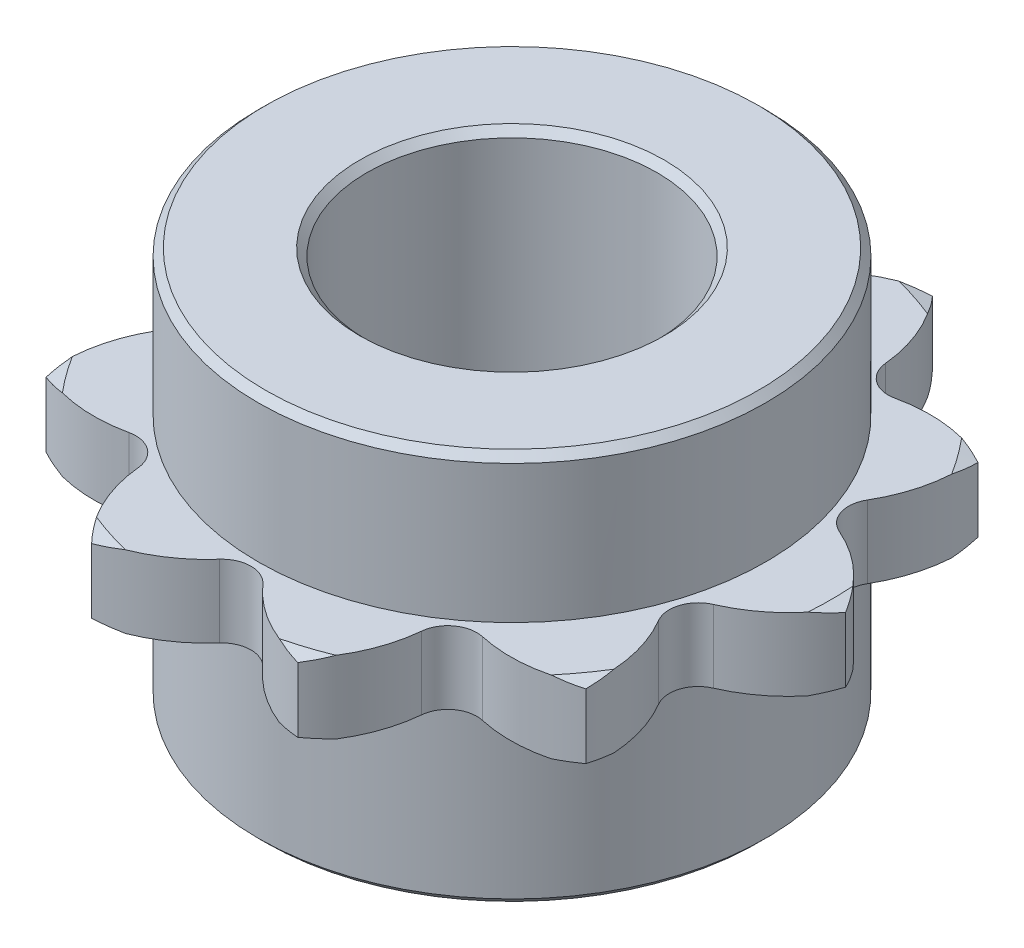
ISO-10303-21;
HEADER;
FILE_DESCRIPTION(('STEP AP214'),'2;1');
FILE_NAME('part.step','',(''),(''),'','','');
FILE_SCHEMA(('AUTOMOTIVE_DESIGN { 1 0 10303 214 1 1 1 1 }'));
ENDSEC;
DATA;
#1=APPLICATION_CONTEXT('core data for automotive mechanical design processes');
#2=APPLICATION_PROTOCOL_DEFINITION('international standard','automotive_design',2000,#1);
#3=PRODUCT_CONTEXT('',#1,'mechanical');
#4=PRODUCT('Part','Part','',(#3));
#5=PRODUCT_RELATED_PRODUCT_CATEGORY('part','',(#4));
#6=PRODUCT_DEFINITION_FORMATION('','',#4);
#7=PRODUCT_DEFINITION_CONTEXT('part definition',#1,'design');
#8=PRODUCT_DEFINITION('design','',#6,#7);
#9=PRODUCT_DEFINITION_SHAPE('','',#8);
#10=(LENGTH_UNIT() NAMED_UNIT(*) SI_UNIT(.MILLI.,.METRE.));
#11=(NAMED_UNIT(*) PLANE_ANGLE_UNIT() SI_UNIT($,.RADIAN.));
#12=(NAMED_UNIT(*) SI_UNIT($,.STERADIAN.) SOLID_ANGLE_UNIT());
#13=UNCERTAINTY_MEASURE_WITH_UNIT(LENGTH_MEASURE(1.E-05),#10,'distance_accuracy_value','');
#14=(GEOMETRIC_REPRESENTATION_CONTEXT(3) GLOBAL_UNCERTAINTY_ASSIGNED_CONTEXT((#13)) GLOBAL_UNIT_ASSIGNED_CONTEXT((#10,
#11,#12)) REPRESENTATION_CONTEXT('',''));
#15=CARTESIAN_POINT('',(0.,0.,0.));
#16=DIRECTION('',(0.,0.,1.));
#17=DIRECTION('',(1.,0.,0.));
#18=AXIS2_PLACEMENT_3D('',#15,#16,#17);
#19=CARTESIAN_POINT('',(0.,16.9433127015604,0.));
#20=DIRECTION('',(0.,-1.,0.));
#21=DIRECTION('',(0.,0.,-1.));
#22=AXIS2_PLACEMENT_3D('',#19,#20,#21);
#23=CONICAL_SURFACE('',#22,11.,1.30899693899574);
#24=CARTESIAN_POINT('',(3.37506504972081,16.7773729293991,11.1183167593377));
#25=CARTESIAN_POINT('',(3.47775883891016,16.7947559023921,11.0193566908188));
#26=CARTESIAN_POINT('',(3.57611389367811,16.8130254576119,10.9160583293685));
#27=CARTESIAN_POINT('',(3.76350353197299,16.8512813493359,10.7016523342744));
#28=CARTESIAN_POINT('',(3.85253965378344,16.8712674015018,10.5905459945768));
#29=CARTESIAN_POINT('',(4.01838971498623,16.9123378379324,10.3644836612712));
#30=CARTESIAN_POINT('',(4.09547078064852,16.9333773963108,10.2497153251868));
#31=CARTESIAN_POINT('',(4.23975881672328,16.9769801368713,10.0144089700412));
#32=CARTESIAN_POINT('',(4.30696585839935,16.9995433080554,9.89387099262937));
#33=CARTESIAN_POINT('',(4.43265851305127,17.0467244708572,9.6447837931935));
#34=CARTESIAN_POINT('',(4.49088187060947,17.0713798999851,9.51610926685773));
#35=CARTESIAN_POINT('',(4.59616500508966,17.1221703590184,9.25454476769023));
#36=CARTESIAN_POINT('',(4.64322388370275,17.1483055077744,9.12165445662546));
#37=CARTESIAN_POINT('',(4.72708549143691,17.2027594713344,8.84876425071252));
#38=CARTESIAN_POINT('',(4.76355399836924,17.2311194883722,8.70866981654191));
#39=CARTESIAN_POINT('',(4.82419173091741,17.2892522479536,8.42613520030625));
#40=CARTESIAN_POINT('',(4.84836125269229,17.3190249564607,8.28369507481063));
#41=CARTESIAN_POINT('',(4.86628976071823,17.3494643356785,8.14061918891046));
#42=B_SPLINE_CURVE_WITH_KNOTS('',3,(#24,#25,#26,#27,#28,#29,#30,#31,#32,#33,#34,#35,#36,#37,#38,
#39,#40,#41),.UNSPECIFIED.,.F.,.F.,(4,2,2,2,2,2,2,2,4),(0.,0.430872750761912,0.861674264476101,
1.28072552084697,1.69977375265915,2.12937494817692,2.559010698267,3.00101374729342,
3.44300615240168),.UNSPECIFIED.);
#43=CARTESIAN_POINT('',(3.55369543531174,16.8093381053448,10.9371499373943));
#44=VERTEX_POINT('',#43);
#45=CARTESIAN_POINT('',(4.12760318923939,16.9433127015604,10.1962194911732));
#46=VERTEX_POINT('',#45);
#47=EDGE_CURVE('E444',#44,#46,#42,.T.);
#48=ORIENTED_EDGE('',*,*,#47,.T.);
#49=CARTESIAN_POINT('',(0.,16.9433127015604,0.));
#50=DIRECTION('',(0.,-1.,0.));
#51=DIRECTION('',(0.,0.,-1.));
#52=AXIS2_PLACEMENT_3D('',#49,#50,#51);
#53=CIRCLE('',#52,11.);
#54=CARTESIAN_POINT('',(2.65388631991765,16.9433127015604,10.6750591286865));
#55=VERTEX_POINT('',#54);
#56=EDGE_CURVE('E1003',#55,#46,#53,.F.);
#57=ORIENTED_EDGE('',*,*,#56,.F.);
#58=CARTESIAN_POINT('',(0.658580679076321,17.4107098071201,9.23219005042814));
#59=CARTESIAN_POINT('',(0.749910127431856,17.3797425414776,9.34154486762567));
#60=CARTESIAN_POINT('',(0.846022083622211,17.3494008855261,9.44708037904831));
#61=CARTESIAN_POINT('',(1.04712054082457,17.2900450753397,9.64974718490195));
#62=CARTESIAN_POINT('',(1.15210761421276,17.2610310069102,9.74687793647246));
#63=CARTESIAN_POINT('',(1.37015555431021,17.204436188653,9.9318718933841));
#64=CARTESIAN_POINT('',(1.48320905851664,17.1768541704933,10.0197433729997));
#65=CARTESIAN_POINT('',(1.71663110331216,17.1231783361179,10.1855962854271));
#66=CARTESIAN_POINT('',(1.83699918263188,17.0970844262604,10.2635783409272));
#67=CARTESIAN_POINT('',(2.20173864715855,17.0223888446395,10.4781223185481));
#68=CARTESIAN_POINT('',(2.45538550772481,16.9759275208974,10.6000457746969));
#69=CARTESIAN_POINT('',(2.98039631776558,16.889419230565,10.7997849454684));
#70=CARTESIAN_POINT('',(3.25175122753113,16.8493690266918,10.8776229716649));
#71=CARTESIAN_POINT('',(3.66603025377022,16.7944286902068,10.9593945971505));
#72=CARTESIAN_POINT('',(3.80536284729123,16.7769677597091,10.9808217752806));
#73=CARTESIAN_POINT('',(4.08557930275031,16.7437836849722,11.0118534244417));
#74=CARTESIAN_POINT('',(4.22646316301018,16.7280605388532,11.0214579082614));
#75=CARTESIAN_POINT('',(4.50907035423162,16.6983636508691,11.0287119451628));
#76=CARTESIAN_POINT('',(4.65079490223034,16.6843943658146,11.0263316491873));
#77=CARTESIAN_POINT('',(4.93371452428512,16.6582851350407,11.0095413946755));
#78=CARTESIAN_POINT('',(5.07490953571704,16.6461453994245,10.9951300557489));
#79=CARTESIAN_POINT('',(5.21531347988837,16.6349390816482,10.9747004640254));
#80=B_SPLINE_CURVE_WITH_KNOTS('',3,(#58,#59,#60,#61,#62,#63,#64,#65,#66,#67,#68,#69,#70,#71,#72,
#73,#74,#75,#76,#77,#78,#79),.UNSPECIFIED.,.F.,.F.,(4,2,2,2,2,2,2,2,2,2,4),(0.,0.43727627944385,
0.87458078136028,1.31149112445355,1.74837394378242,2.59985876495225,3.45091226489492,
3.87662849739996,4.30234426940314,4.72912084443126,5.15594639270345),.UNSPECIFIED.);
#81=EDGE_CURVE('E57',#55,#44,#80,.T.);
#82=ORIENTED_EDGE('',*,*,#81,.T.);
#83=EDGE_LOOP('',(#48,#57,#82));
#84=FACE_BOUND('',#83,.T.);
#85=ADVANCED_FACE('F34',(#84),#23,.T.);
#86=CARTESIAN_POINT('',(0.,14.5772872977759,0.));
#87=DIRECTION('',(0.,1.,0.));
#88=DIRECTION('',(0.,0.,1.));
#89=AXIS2_PLACEMENT_3D('',#86,#87,#88);
#90=CONICAL_SURFACE('',#89,11.5,1.30899693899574);
#91=CARTESIAN_POINT('',(4.86628976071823,14.0371610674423,8.14061918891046));
#92=CARTESIAN_POINT('',(4.84836125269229,14.06760044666,8.28369507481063));
#93=CARTESIAN_POINT('',(4.82419173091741,14.0973731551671,8.42613520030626));
#94=CARTESIAN_POINT('',(4.76355399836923,14.1555059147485,8.70866981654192));
#95=CARTESIAN_POINT('',(4.72708549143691,14.1838659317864,8.84876425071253));
#96=CARTESIAN_POINT('',(4.64322388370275,14.2383198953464,9.12165445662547));
#97=CARTESIAN_POINT('',(4.59616500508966,14.2644550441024,9.25454476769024));
#98=CARTESIAN_POINT('',(4.49088187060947,14.3152455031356,9.51610926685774));
#99=CARTESIAN_POINT('',(4.43265851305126,14.3399009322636,9.64478379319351));
#100=CARTESIAN_POINT('',(4.30696585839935,14.3870820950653,9.89387099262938));
#101=CARTESIAN_POINT('',(4.23975881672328,14.4096452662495,10.0144089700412));
#102=CARTESIAN_POINT('',(4.09547078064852,14.45324800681,10.2497153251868));
#103=CARTESIAN_POINT('',(4.01838971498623,14.4742875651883,10.3644836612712));
#104=CARTESIAN_POINT('',(3.85253965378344,14.5153580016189,10.5905459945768));
#105=CARTESIAN_POINT('',(3.76350353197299,14.5353440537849,10.7016523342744));
#106=CARTESIAN_POINT('',(3.57611389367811,14.5735999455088,10.9160583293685));
#107=CARTESIAN_POINT('',(3.47775883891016,14.5918695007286,11.0193566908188));
#108=CARTESIAN_POINT('',(3.37506504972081,14.6092524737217,11.1183167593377));
#109=B_SPLINE_CURVE_WITH_KNOTS('',3,(#91,#92,#93,#94,#95,#96,#97,#98,#99,#100,#101,#102,#103,
#104,#105,#106,#107,#108),.UNSPECIFIED.,.F.,.F.,(4,2,2,2,2,2,2,2,4),(0.,0.441992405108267,
0.883995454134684,1.31363120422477,1.74323239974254,2.16228063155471,2.58133188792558,
3.01213340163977,3.44300615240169),.UNSPECIFIED.);
#110=CARTESIAN_POINT('',(4.12760318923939,14.4433127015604,10.1962194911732));
#111=VERTEX_POINT('',#110);
#112=CARTESIAN_POINT('',(3.55369543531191,14.5772872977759,10.9371499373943));
#113=VERTEX_POINT('',#112);
#114=EDGE_CURVE('E463',#111,#113,#109,.T.);
#115=ORIENTED_EDGE('',*,*,#114,.T.);
#116=CARTESIAN_POINT('',(0.658580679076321,13.9759155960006,9.23219005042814));
#117=CARTESIAN_POINT('',(0.749910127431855,14.0068828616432,9.34154486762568));
#118=CARTESIAN_POINT('',(0.846022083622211,14.0372245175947,9.44708037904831));
#119=CARTESIAN_POINT('',(1.04712054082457,14.0965803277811,9.64974718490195));
#120=CARTESIAN_POINT('',(1.15210761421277,14.1255943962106,9.74687793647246));
#121=CARTESIAN_POINT('',(1.37015555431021,14.1821892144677,9.9318718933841));
#122=CARTESIAN_POINT('',(1.48320905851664,14.2097712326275,10.0197433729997));
#123=CARTESIAN_POINT('',(1.71663110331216,14.2634470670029,10.1855962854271));
#124=CARTESIAN_POINT('',(1.83699918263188,14.2895409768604,10.2635783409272));
#125=CARTESIAN_POINT('',(2.20173864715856,14.3642365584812,10.4781223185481));
#126=CARTESIAN_POINT('',(2.45538550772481,14.4106978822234,10.6000457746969));
#127=CARTESIAN_POINT('',(2.98039631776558,14.4972061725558,10.7997849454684));
#128=CARTESIAN_POINT('',(3.25175122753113,14.5372563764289,10.8776229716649));
#129=CARTESIAN_POINT('',(3.66603025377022,14.5921967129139,10.9593945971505));
#130=CARTESIAN_POINT('',(3.80536284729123,14.6096576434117,10.9808217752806));
#131=CARTESIAN_POINT('',(4.08557930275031,14.6428417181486,11.0118534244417));
#132=CARTESIAN_POINT('',(4.22646316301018,14.6585648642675,11.0214579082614));
#133=CARTESIAN_POINT('',(4.50907035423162,14.6882617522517,11.0287119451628));
#134=CARTESIAN_POINT('',(4.65079490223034,14.7022310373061,11.0263316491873));
#135=CARTESIAN_POINT('',(4.93371452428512,14.7283402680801,11.0095413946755));
#136=CARTESIAN_POINT('',(5.07490953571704,14.7404800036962,10.9951300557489));
#137=CARTESIAN_POINT('',(5.21531347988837,14.7516863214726,10.9747004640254));
#138=B_SPLINE_CURVE_WITH_KNOTS('',3,(#116,#117,#118,#119,#120,#121,#122,#123,#124,#125,#126,
#127,#128,#129,#130,#131,#132,#133,#134,#135,#136,#137),.UNSPECIFIED.,.F.,.F.,(4,2,2,2,2,2,2,2,
2,2,4),(0.,0.437276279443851,0.874580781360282,1.31149112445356,1.74837394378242,
2.59985876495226,3.45091226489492,3.87662849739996,4.30234426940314,4.72912084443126,
5.15594639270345),.UNSPECIFIED.);
#139=CARTESIAN_POINT('',(2.65388631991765,14.4433127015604,10.6750591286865));
#140=VERTEX_POINT('',#139);
#141=EDGE_CURVE('E1073',#113,#140,#138,.F.);
#142=ORIENTED_EDGE('',*,*,#141,.T.);
#143=CARTESIAN_POINT('',(0.,14.4433127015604,0.));
#144=DIRECTION('',(0.,1.,0.));
#145=DIRECTION('',(0.,0.,1.));
#146=AXIS2_PLACEMENT_3D('',#143,#144,#145);
#147=CIRCLE('',#146,11.);
#148=EDGE_CURVE('E49',#111,#140,#147,.F.);
#149=ORIENTED_EDGE('',*,*,#148,.F.);
#150=EDGE_LOOP('',(#115,#142,#149));
#151=FACE_BOUND('',#150,.T.);
#152=ADVANCED_FACE('F499',(#151),#90,.T.);
#153=CARTESIAN_POINT('',(8.42043886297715,16.9435127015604,7.07670748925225));
#154=CARTESIAN_POINT('',(8.49626853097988,16.9313066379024,7.05728408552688));
#155=CARTESIAN_POINT('',(8.57167885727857,16.9193471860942,7.03606759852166));
#156=CARTESIAN_POINT('',(8.72132574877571,16.8959566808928,6.99014241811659));
#157=CARTESIAN_POINT('',(8.79556453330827,16.8845245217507,6.96544151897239));
#158=CARTESIAN_POINT('',(8.94286903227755,16.8621698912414,6.91255542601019));
#159=CARTESIAN_POINT('',(9.0159347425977,16.8512474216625,6.88437021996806));
#160=CARTESIAN_POINT('',(9.16088626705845,16.8298974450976,6.82450520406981));
#161=CARTESIAN_POINT('',(9.23276912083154,16.8194710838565,6.79281781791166));
#162=CARTESIAN_POINT('',(9.30389543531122,16.809309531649,6.759436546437));
#163=B_SPLINE_CURVE_WITH_KNOTS('',3,(#153,#154,#155,#156,#157,#158,#159,#160,#161,#162),
.UNSPECIFIED.,.F.,.F.,(4,2,2,2,4),(0.,0.237649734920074,0.474776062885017,0.711903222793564,
0.949553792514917),.UNSPECIFIED.);
#164=CARTESIAN_POINT('',(8.42168145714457,16.9433127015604,7.0763890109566));
#165=VERTEX_POINT('',#164);
#166=CARTESIAN_POINT('',(9.30369543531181,16.8093381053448,6.75953040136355));
#167=VERTEX_POINT('',#166);
#168=EDGE_CURVE('E358',#165,#167,#163,.T.);
#169=ORIENTED_EDGE('',*,*,#168,.T.);
#170=CARTESIAN_POINT('',(9.30367038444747,16.8093120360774,6.75973040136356));
#171=CARTESIAN_POINT('',(9.3134381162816,16.8194734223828,6.68177145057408));
#172=CARTESIAN_POINT('',(9.32136115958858,16.8298996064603,6.6036164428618));
#173=CARTESIAN_POINT('',(9.33350298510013,16.8512492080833,6.4472632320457));
#174=CARTESIAN_POINT('',(9.33772988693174,16.8621714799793,6.36906550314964));
#175=CARTESIAN_POINT('',(9.3425075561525,16.8845256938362,6.21263110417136));
#176=CARTESIAN_POINT('',(9.34305833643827,16.895957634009,6.13439443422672));
#177=CARTESIAN_POINT('',(9.34049224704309,16.919347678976,5.97788334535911));
#178=CARTESIAN_POINT('',(9.33736727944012,16.9313068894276,5.89960922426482));
#179=CARTESIAN_POINT('',(9.33240748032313,16.9435127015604,5.82149037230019));
#180=B_SPLINE_CURVE_WITH_KNOTS('',3,(#170,#171,#172,#173,#174,#175,#176,#177,#178,#179),
.UNSPECIFIED.,.F.,.F.,(4,2,2,2,4),(0.,0.237645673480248,0.474767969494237,0.71188943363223,
0.949534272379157),.UNSPECIFIED.);
#181=CARTESIAN_POINT('',(9.3324885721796,16.9433127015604,5.82277056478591));
#182=VERTEX_POINT('',#181);
#183=EDGE_CURVE('E365',#167,#182,#180,.T.);
#184=ORIENTED_EDGE('',*,*,#183,.T.);
#185=EDGE_CURVE('E372',#165,#182,#53,.F.);
#186=ORIENTED_EDGE('',*,*,#185,.F.);
#187=EDGE_LOOP('',(#169,#184,#186));
#188=FACE_BOUND('',#187,.T.);
#189=ADVANCED_FACE('F371',(#188),#23,.T.);
#190=CARTESIAN_POINT('',(9.30389543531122,14.5773158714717,6.759436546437));
#191=CARTESIAN_POINT('',(9.23276912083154,14.5671543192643,6.79281781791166));
#192=CARTESIAN_POINT('',(9.16088626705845,14.5567279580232,6.82450520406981));
#193=CARTESIAN_POINT('',(9.0159347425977,14.5353779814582,6.88437021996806));
#194=CARTESIAN_POINT('',(8.94286903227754,14.5244555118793,6.91255542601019));
#195=CARTESIAN_POINT('',(8.79556453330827,14.50210088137,6.96544151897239));
#196=CARTESIAN_POINT('',(8.7213257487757,14.4906687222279,6.99014241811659));
#197=CARTESIAN_POINT('',(8.57167885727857,14.4672782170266,7.03606759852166));
#198=CARTESIAN_POINT('',(8.49626853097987,14.4553187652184,7.05728408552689));
#199=CARTESIAN_POINT('',(8.42043886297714,14.4431127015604,7.07670748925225));
#200=B_SPLINE_CURVE_WITH_KNOTS('',3,(#190,#191,#192,#193,#194,#195,#196,#197,#198,#199),
.UNSPECIFIED.,.F.,.F.,(4,2,2,2,4),(0.,0.237650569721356,0.474777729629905,0.711904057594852,
0.949553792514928),.UNSPECIFIED.);
#201=CARTESIAN_POINT('',(9.30369543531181,14.5772872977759,6.75953040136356));
#202=VERTEX_POINT('',#201);
#203=CARTESIAN_POINT('',(8.42168145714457,14.4433127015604,7.0763890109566));
#204=VERTEX_POINT('',#203);
#205=EDGE_CURVE('E361',#202,#204,#200,.T.);
#206=ORIENTED_EDGE('',*,*,#205,.T.);
#207=CARTESIAN_POINT('',(9.3324885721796,14.4433127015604,5.82277056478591));
#208=VERTEX_POINT('',#207);
#209=EDGE_CURVE('E1147',#208,#204,#147,.F.);
#210=ORIENTED_EDGE('',*,*,#209,.F.);
#211=CARTESIAN_POINT('',(9.33240748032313,14.4431127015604,5.82149037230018));
#212=CARTESIAN_POINT('',(9.33736727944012,14.4553185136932,5.89960922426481));
#213=CARTESIAN_POINT('',(9.34049224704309,14.4672777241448,5.9778833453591));
#214=CARTESIAN_POINT('',(9.34305833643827,14.4906677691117,6.13439443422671));
#215=CARTESIAN_POINT('',(9.3425075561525,14.5020997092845,6.21263110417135));
#216=CARTESIAN_POINT('',(9.33772988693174,14.5244539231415,6.36906550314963));
#217=CARTESIAN_POINT('',(9.33350298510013,14.5353761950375,6.4472632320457));
#218=CARTESIAN_POINT('',(9.32136115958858,14.5567257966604,6.60361644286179));
#219=CARTESIAN_POINT('',(9.3134381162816,14.567151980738,6.68177145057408));
#220=CARTESIAN_POINT('',(9.30367038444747,14.5773133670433,6.75973040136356));
#221=B_SPLINE_CURVE_WITH_KNOTS('',3,(#211,#212,#213,#214,#215,#216,#217,#218,#219,#220),
.UNSPECIFIED.,.F.,.F.,(4,2,2,2,4),(0.,0.23764483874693,0.474766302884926,0.711888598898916,
0.949534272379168),.UNSPECIFIED.);
#222=EDGE_CURVE('E379',#208,#202,#221,.T.);
#223=ORIENTED_EDGE('',*,*,#222,.T.);
#224=EDGE_LOOP('',(#206,#210,#223));
#225=FACE_BOUND('',#224,.T.);
#226=ADVANCED_FACE('F508',(#225),#90,.T.);
#227=CARTESIAN_POINT('',(9.10857090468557,17.3815332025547,2.17451683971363));
#228=CARTESIAN_POINT('',(9.24100709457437,17.3505870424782,2.11716494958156));
#229=CARTESIAN_POINT('',(9.37107937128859,17.3202946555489,2.05399041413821));
#230=CARTESIAN_POINT('',(9.62551493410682,17.2610986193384,1.91647379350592));
#231=CARTESIAN_POINT('',(9.74987807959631,17.2321950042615,1.84213143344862));
#232=CARTESIAN_POINT('',(9.98852164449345,17.1766473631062,1.68498935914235));
#233=CARTESIAN_POINT('',(10.102986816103,17.149962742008,1.60248447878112));
#234=CARTESIAN_POINT('',(10.3247277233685,17.0980542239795,1.42792179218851));
#235=CARTESIAN_POINT('',(10.4320040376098,17.0728302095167,1.3358647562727));
#236=CARTESIAN_POINT('',(10.6359939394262,17.0245142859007,1.14520037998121));
#237=CARTESIAN_POINT('',(10.7329035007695,17.0013850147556,1.04681210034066));
#238=CARTESIAN_POINT('',(10.9184054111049,16.9566341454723,0.842163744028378));
#239=CARTESIAN_POINT('',(11.0069977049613,16.9350125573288,0.73590361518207));
#240=CARTESIAN_POINT('',(11.177558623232,16.8927472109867,0.513125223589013));
#241=CARTESIAN_POINT('',(11.2592719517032,16.8721478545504,0.396402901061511));
#242=CARTESIAN_POINT('',(11.4125785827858,16.8326515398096,0.15619207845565));
#243=CARTESIAN_POINT('',(11.4841701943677,16.8137548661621,0.0327024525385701));
#244=CARTESIAN_POINT('',(11.5503730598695,16.7957387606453,-0.0937407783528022));
#245=B_SPLINE_CURVE_WITH_KNOTS('',3,(#227,#228,#229,#230,#231,#232,#233,#234,#235,#236,#237,
#238,#239,#240,#241,#242,#243,#244),.UNSPECIFIED.,.F.,.F.,(4,2,2,2,2,2,2,2,4),(0.,
0.442679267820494,0.885369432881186,1.31567326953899,1.7459424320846,2.16554113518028,
2.58514261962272,3.01650659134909,3.44794254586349),.UNSPECIFIED.);
#246=CARTESIAN_POINT('',(10.9726805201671,16.9433127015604,0.774778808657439));
#247=VERTEX_POINT('',#246);
#248=CARTESIAN_POINT('',(11.5,16.8093381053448,1.17527515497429E-13));
#249=VERTEX_POINT('',#248);
#250=EDGE_CURVE('E398',#247,#249,#245,.T.);
#251=ORIENTED_EDGE('',*,*,#250,.T.);
#252=CARTESIAN_POINT('',(11.5503730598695,16.7957387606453,0.0937407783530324));
#253=CARTESIAN_POINT('',(11.4841701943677,16.8137548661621,-0.0327024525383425));
#254=CARTESIAN_POINT('',(11.4125785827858,16.8326515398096,-0.156192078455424));
#255=CARTESIAN_POINT('',(11.2592719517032,16.8721478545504,-0.396402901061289));
#256=CARTESIAN_POINT('',(11.177558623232,16.8927472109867,-0.513125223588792));
#257=CARTESIAN_POINT('',(11.0069977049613,16.9350125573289,-0.735903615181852));
#258=CARTESIAN_POINT('',(10.9184054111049,16.9566341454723,-0.842163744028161));
#259=CARTESIAN_POINT('',(10.7329035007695,17.0013850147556,-1.04681210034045));
#260=CARTESIAN_POINT('',(10.6359939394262,17.0245142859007,-1.145200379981));
#261=CARTESIAN_POINT('',(10.4320040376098,17.0728302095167,-1.33586475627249));
#262=CARTESIAN_POINT('',(10.3247277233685,17.0980542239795,-1.4279217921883));
#263=CARTESIAN_POINT('',(10.102986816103,17.149962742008,-1.60248447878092));
#264=CARTESIAN_POINT('',(9.98852164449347,17.1766473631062,-1.68498935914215));
#265=CARTESIAN_POINT('',(9.74987807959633,17.2321950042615,-1.84213143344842));
#266=CARTESIAN_POINT('',(9.62551493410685,17.2610986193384,-1.91647379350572));
#267=CARTESIAN_POINT('',(9.37107937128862,17.3202946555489,-2.05399041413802));
#268=CARTESIAN_POINT('',(9.2410070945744,17.3505870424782,-2.11716494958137));
#269=CARTESIAN_POINT('',(9.1085709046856,17.3815332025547,-2.17451683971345));
#270=B_SPLINE_CURVE_WITH_KNOTS('',3,(#252,#253,#254,#255,#256,#257,#258,#259,#260,#261,#262,
#263,#264,#265,#266,#267,#268,#269),.UNSPECIFIED.,.F.,.F.,(4,2,2,2,2,2,2,2,4),(0.,
0.431435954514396,0.862799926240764,1.28240141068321,1.70200011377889,2.1322692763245,
2.5625731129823,3.005263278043,3.44794254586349),.UNSPECIFIED.);
#271=CARTESIAN_POINT('',(10.9726805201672,16.9433127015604,-0.774778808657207));
#272=VERTEX_POINT('',#271);
#273=EDGE_CURVE('E593',#249,#272,#270,.T.);
#274=ORIENTED_EDGE('',*,*,#273,.T.);
#275=EDGE_CURVE('E594',#247,#272,#53,.F.);
#276=ORIENTED_EDGE('',*,*,#275,.F.);
#277=EDGE_LOOP('',(#251,#274,#276));
#278=FACE_BOUND('',#277,.T.);
#279=ADVANCED_FACE('F513',(#278),#23,.T.);
#280=CARTESIAN_POINT('',(11.5503730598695,14.5908866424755,-0.0937407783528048));
#281=CARTESIAN_POINT('',(11.4841701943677,14.5728705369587,0.0327024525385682));
#282=CARTESIAN_POINT('',(11.4125785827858,14.5539738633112,0.156192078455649));
#283=CARTESIAN_POINT('',(11.2592719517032,14.5144775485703,0.396402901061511));
#284=CARTESIAN_POINT('',(11.177558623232,14.4938781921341,0.513125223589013));
#285=CARTESIAN_POINT('',(11.0069977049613,14.4516128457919,0.73590361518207));
#286=CARTESIAN_POINT('',(10.9184054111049,14.4299912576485,0.842163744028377));
#287=CARTESIAN_POINT('',(10.7329035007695,14.3852403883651,1.04681210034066));
#288=CARTESIAN_POINT('',(10.6359939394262,14.36211111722,1.14520037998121));
#289=CARTESIAN_POINT('',(10.4320040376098,14.3137951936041,1.3358647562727));
#290=CARTESIAN_POINT('',(10.3247277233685,14.2885711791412,1.42792179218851));
#291=CARTESIAN_POINT('',(10.102986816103,14.2366626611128,1.60248447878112));
#292=CARTESIAN_POINT('',(9.98852164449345,14.2099780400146,1.68498935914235));
#293=CARTESIAN_POINT('',(9.74987807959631,14.1544303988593,1.84213143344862));
#294=CARTESIAN_POINT('',(9.62551493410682,14.1255267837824,1.91647379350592));
#295=CARTESIAN_POINT('',(9.37107937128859,14.0663307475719,2.05399041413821));
#296=CARTESIAN_POINT('',(9.24100709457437,14.0360383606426,2.11716494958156));
#297=CARTESIAN_POINT('',(9.10857090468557,14.0050922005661,2.17451683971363));
#298=B_SPLINE_CURVE_WITH_KNOTS('',3,(#280,#281,#282,#283,#284,#285,#286,#287,#288,#289,#290,
#291,#292,#293,#294,#295,#296,#297),.UNSPECIFIED.,.F.,.F.,(4,2,2,2,2,2,2,2,4),(0.,
0.431435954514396,0.862799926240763,1.2824014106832,1.70200011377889,2.1322692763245,
2.5625731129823,3.00526327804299,3.44794254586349),.UNSPECIFIED.);
#299=CARTESIAN_POINT('',(11.5,14.5772872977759,1.23599047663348E-13));
#300=VERTEX_POINT('',#299);
#301=CARTESIAN_POINT('',(10.9726805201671,14.4433127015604,0.774778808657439));
#302=VERTEX_POINT('',#301);
#303=EDGE_CURVE('E391',#300,#302,#298,.T.);
#304=ORIENTED_EDGE('',*,*,#303,.T.);
#305=CARTESIAN_POINT('',(10.9726805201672,14.4433127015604,-0.774778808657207));
#306=VERTEX_POINT('',#305);
#307=EDGE_CURVE('E1182',#306,#302,#147,.F.);
#308=ORIENTED_EDGE('',*,*,#307,.F.);
#309=CARTESIAN_POINT('',(9.1085709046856,14.0050922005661,-2.17451683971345));
#310=CARTESIAN_POINT('',(9.2410070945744,14.0360383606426,-2.11716494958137));
#311=CARTESIAN_POINT('',(9.37107937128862,14.0663307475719,-2.05399041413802));
#312=CARTESIAN_POINT('',(9.62551493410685,14.1255267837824,-1.91647379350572));
#313=CARTESIAN_POINT('',(9.74987807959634,14.1544303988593,-1.84213143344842));
#314=CARTESIAN_POINT('',(9.98852164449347,14.2099780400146,-1.68498935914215));
#315=CARTESIAN_POINT('',(10.102986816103,14.2366626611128,-1.60248447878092));
#316=CARTESIAN_POINT('',(10.3247277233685,14.2885711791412,-1.4279217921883));
#317=CARTESIAN_POINT('',(10.4320040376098,14.3137951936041,-1.33586475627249));
#318=CARTESIAN_POINT('',(10.6359939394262,14.36211111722,-1.145200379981));
#319=CARTESIAN_POINT('',(10.7329035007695,14.3852403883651,-1.04681210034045));
#320=CARTESIAN_POINT('',(10.9184054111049,14.4299912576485,-0.842163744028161));
#321=CARTESIAN_POINT('',(11.0069977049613,14.4516128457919,-0.735903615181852));
#322=CARTESIAN_POINT('',(11.177558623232,14.4938781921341,-0.513125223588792));
#323=CARTESIAN_POINT('',(11.2592719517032,14.5144775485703,-0.396402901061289));
#324=CARTESIAN_POINT('',(11.4125785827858,14.5539738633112,-0.156192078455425));
#325=CARTESIAN_POINT('',(11.4841701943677,14.5728705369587,-0.0327024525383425));
#326=CARTESIAN_POINT('',(11.5503730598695,14.5908866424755,0.0937407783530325));
#327=B_SPLINE_CURVE_WITH_KNOTS('',3,(#309,#310,#311,#312,#313,#314,#315,#316,#317,#318,#319,
#320,#321,#322,#323,#324,#325,#326),.UNSPECIFIED.,.F.,.F.,(4,2,2,2,2,2,2,2,4),(0.,
0.442679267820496,0.885369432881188,1.31567326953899,1.7459424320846,2.16554113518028,
2.58514261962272,3.01650659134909,3.44794254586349),.UNSPECIFIED.);
#328=EDGE_CURVE('E603',#306,#300,#327,.T.);
#329=ORIENTED_EDGE('',*,*,#328,.T.);
#330=EDGE_LOOP('',(#304,#308,#329));
#331=FACE_BOUND('',#330,.T.);
#332=ADVANCED_FACE('F574',(#331),#90,.T.);
#333=CARTESIAN_POINT('',(9.33240748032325,16.9435127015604,-5.8214903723));
#334=CARTESIAN_POINT('',(9.33736727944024,16.9313068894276,-5.89960922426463));
#335=CARTESIAN_POINT('',(9.34049224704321,16.919347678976,-5.97788334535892));
#336=CARTESIAN_POINT('',(9.3430583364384,16.895957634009,-6.13439443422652));
#337=CARTESIAN_POINT('',(9.34250755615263,16.8845256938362,-6.21263110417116));
#338=CARTESIAN_POINT('',(9.33772988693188,16.8621714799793,-6.36906550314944));
#339=CARTESIAN_POINT('',(9.33350298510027,16.8512492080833,-6.4472632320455));
#340=CARTESIAN_POINT('',(9.32136115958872,16.8298996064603,-6.6036164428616));
#341=CARTESIAN_POINT('',(9.31343811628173,16.8194734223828,-6.68177145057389));
#342=CARTESIAN_POINT('',(9.30367038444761,16.8093120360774,-6.75973040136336));
#343=B_SPLINE_CURVE_WITH_KNOTS('',3,(#333,#334,#335,#336,#337,#338,#339,#340,#341,#342),
.UNSPECIFIED.,.F.,.F.,(4,2,2,2,4),(0.,0.237644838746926,0.474766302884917,0.711888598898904,
0.949534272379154),.UNSPECIFIED.);
#344=CARTESIAN_POINT('',(9.33248857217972,16.9433127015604,-5.82277056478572));
#345=VERTEX_POINT('',#344);
#346=CARTESIAN_POINT('',(9.30369543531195,16.8093381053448,-6.75953040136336));
#347=VERTEX_POINT('',#346);
#348=EDGE_CURVE('E621',#345,#347,#343,.T.);
#349=ORIENTED_EDGE('',*,*,#348,.T.);
#350=CARTESIAN_POINT('',(9.30389543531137,16.809309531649,-6.75943654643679));
#351=CARTESIAN_POINT('',(9.23276912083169,16.8194710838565,-6.79281781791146));
#352=CARTESIAN_POINT('',(9.1608862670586,16.8298974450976,-6.82450520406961));
#353=CARTESIAN_POINT('',(9.01593474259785,16.8512474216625,-6.88437021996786));
#354=CARTESIAN_POINT('',(8.9428690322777,16.8621698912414,-6.91255542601));
#355=CARTESIAN_POINT('',(8.79556453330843,16.8845245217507,-6.9654415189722));
#356=CARTESIAN_POINT('',(8.72132574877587,16.8959566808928,-6.9901424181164));
#357=CARTESIAN_POINT('',(8.57167885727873,16.9193471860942,-7.03606759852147));
#358=CARTESIAN_POINT('',(8.49626853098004,16.9313066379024,-7.0572840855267));
#359=CARTESIAN_POINT('',(8.42043886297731,16.9435127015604,-7.07670748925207));
#360=B_SPLINE_CURVE_WITH_KNOTS('',3,(#350,#351,#352,#353,#354,#355,#356,#357,#358,#359),
.UNSPECIFIED.,.F.,.F.,(4,2,2,2,4),(0.,0.237650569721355,0.4747777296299,0.71190405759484,
0.949553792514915),.UNSPECIFIED.);
#361=CARTESIAN_POINT('',(8.42168145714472,16.9433127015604,-7.07638901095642));
#362=VERTEX_POINT('',#361);
#363=EDGE_CURVE('E661',#347,#362,#360,.T.);
#364=ORIENTED_EDGE('',*,*,#363,.T.);
#365=EDGE_CURVE('E1163',#345,#362,#53,.F.);
#366=ORIENTED_EDGE('',*,*,#365,.F.);
#367=EDGE_LOOP('',(#349,#364,#366));
#368=FACE_BOUND('',#367,.T.);
#369=ADVANCED_FACE('F569',(#368),#23,.T.);
#370=CARTESIAN_POINT('',(9.30367038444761,14.5773133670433,-6.75973040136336));
#371=CARTESIAN_POINT('',(9.31343811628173,14.567151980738,-6.68177145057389));
#372=CARTESIAN_POINT('',(9.32136115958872,14.5567257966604,-6.6036164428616));
#373=CARTESIAN_POINT('',(9.33350298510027,14.5353761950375,-6.4472632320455));
#374=CARTESIAN_POINT('',(9.33772988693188,14.5244539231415,-6.36906550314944));
#375=CARTESIAN_POINT('',(9.34250755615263,14.5020997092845,-6.21263110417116));
#376=CARTESIAN_POINT('',(9.3430583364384,14.4906677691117,-6.13439443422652));
#377=CARTESIAN_POINT('',(9.34049224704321,14.4672777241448,-5.97788334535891));
#378=CARTESIAN_POINT('',(9.33736727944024,14.4553185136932,-5.89960922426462));
#379=CARTESIAN_POINT('',(9.33240748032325,14.4431127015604,-5.82149037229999));
#380=B_SPLINE_CURVE_WITH_KNOTS('',3,(#370,#371,#372,#373,#374,#375,#376,#377,#378,#379),
.UNSPECIFIED.,.F.,.F.,(4,2,2,2,4),(0.,0.237645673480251,0.474767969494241,0.711889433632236,
0.949534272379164),.UNSPECIFIED.);
#381=CARTESIAN_POINT('',(9.30369543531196,14.5772872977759,-6.75953040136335));
#382=VERTEX_POINT('',#381);
#383=CARTESIAN_POINT('',(9.33248857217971,14.4433127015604,-5.82277056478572));
#384=VERTEX_POINT('',#383);
#385=EDGE_CURVE('E615',#382,#384,#380,.T.);
#386=ORIENTED_EDGE('',*,*,#385,.T.);
#387=CARTESIAN_POINT('',(8.42168145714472,14.4433127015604,-7.07638901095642));
#388=VERTEX_POINT('',#387);
#389=EDGE_CURVE('E1184',#388,#384,#147,.F.);
#390=ORIENTED_EDGE('',*,*,#389,.F.);
#391=CARTESIAN_POINT('',(8.4204388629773,14.4431127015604,-7.07670748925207));
#392=CARTESIAN_POINT('',(8.49626853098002,14.4553187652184,-7.0572840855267));
#393=CARTESIAN_POINT('',(8.57167885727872,14.4672782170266,-7.03606759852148));
#394=CARTESIAN_POINT('',(8.72132574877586,14.4906687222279,-6.9901424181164));
#395=CARTESIAN_POINT('',(8.79556453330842,14.50210088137,-6.9654415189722));
#396=CARTESIAN_POINT('',(8.94286903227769,14.5244555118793,-6.91255542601));
#397=CARTESIAN_POINT('',(9.01593474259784,14.5353779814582,-6.88437021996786));
#398=CARTESIAN_POINT('',(9.1608862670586,14.5567279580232,-6.82450520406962));
#399=CARTESIAN_POINT('',(9.23276912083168,14.5671543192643,-6.79281781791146));
#400=CARTESIAN_POINT('',(9.30389543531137,14.5773158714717,-6.75943654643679));
#401=B_SPLINE_CURVE_WITH_KNOTS('',3,(#391,#392,#393,#394,#395,#396,#397,#398,#399,#400),
.UNSPECIFIED.,.F.,.F.,(4,2,2,2,4),(0.,0.237649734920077,0.474776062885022,0.711903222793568,
0.949553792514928),.UNSPECIFIED.);
#402=EDGE_CURVE('E665',#388,#382,#401,.T.);
#403=ORIENTED_EDGE('',*,*,#402,.T.);
#404=EDGE_LOOP('',(#386,#390,#403));
#405=FACE_BOUND('',#404,.T.);
#406=ADVANCED_FACE('F565',(#405),#90,.T.);
#407=CARTESIAN_POINT('',(4.8662897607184,17.3494643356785,-8.1406191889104));
#408=CARTESIAN_POINT('',(4.84836125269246,17.3190249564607,-8.28369507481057));
#409=CARTESIAN_POINT('',(4.82419173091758,17.2892522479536,-8.4261352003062));
#410=CARTESIAN_POINT('',(4.76355399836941,17.2311194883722,-8.70866981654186));
#411=CARTESIAN_POINT('',(4.72708549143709,17.2027594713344,-8.84876425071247));
#412=CARTESIAN_POINT('',(4.64322388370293,17.1483055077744,-9.12165445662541));
#413=CARTESIAN_POINT('',(4.59616500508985,17.1221703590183,-9.25454476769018));
#414=CARTESIAN_POINT('',(4.49088187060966,17.0713798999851,-9.51610926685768));
#415=CARTESIAN_POINT('',(4.43265851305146,17.0467244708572,-9.64478379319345));
#416=CARTESIAN_POINT('',(4.30696585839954,16.9995433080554,-9.89387099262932));
#417=CARTESIAN_POINT('',(4.23975881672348,16.9769801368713,-10.0144089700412));
#418=CARTESIAN_POINT('',(4.09547078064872,16.9333773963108,-10.2497153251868));
#419=CARTESIAN_POINT('',(4.01838971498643,16.9123378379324,-10.3644836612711));
#420=CARTESIAN_POINT('',(3.85253965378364,16.8712674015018,-10.5905459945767));
#421=CARTESIAN_POINT('',(3.76350353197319,16.8512813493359,-10.7016523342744));
#422=CARTESIAN_POINT('',(3.57611389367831,16.8130254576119,-10.9160583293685));
#423=CARTESIAN_POINT('',(3.47775883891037,16.7947559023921,-11.0193566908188));
#424=CARTESIAN_POINT('',(3.37506504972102,16.7773729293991,-11.1183167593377));
#425=B_SPLINE_CURVE_WITH_KNOTS('',3,(#407,#408,#409,#410,#411,#412,#413,#414,#415,#416,#417,
#418,#419,#420,#421,#422,#423,#424),.UNSPECIFIED.,.F.,.F.,(4,2,2,2,2,2,2,2,4),(0.,
0.441992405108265,0.883995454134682,1.31363120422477,1.74323239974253,2.16228063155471,
2.58133188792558,3.01213340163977,3.44300615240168),.UNSPECIFIED.);
#426=CARTESIAN_POINT('',(4.12760318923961,16.9433127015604,-10.1962194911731));
#427=VERTEX_POINT('',#426);
#428=CARTESIAN_POINT('',(3.55369543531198,16.8093381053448,-10.9371499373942));
#429=VERTEX_POINT('',#428);
#430=EDGE_CURVE('E675',#427,#429,#425,.T.);
#431=ORIENTED_EDGE('',*,*,#430,.T.);
#432=CARTESIAN_POINT('',(0.658580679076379,17.4107098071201,-9.23219005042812));
#433=CARTESIAN_POINT('',(0.749910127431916,17.3797425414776,-9.34154486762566));
#434=CARTESIAN_POINT('',(0.846022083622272,17.3494008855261,-9.44708037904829));
#435=CARTESIAN_POINT('',(1.04712054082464,17.2900450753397,-9.64974718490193));
#436=CARTESIAN_POINT('',(1.15210761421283,17.2610310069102,-9.74687793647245));
#437=CARTESIAN_POINT('',(1.37015555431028,17.204436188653,-9.93187189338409));
#438=CARTESIAN_POINT('',(1.4832090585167,17.1768541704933,-10.0197433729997));
#439=CARTESIAN_POINT('',(1.71663110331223,17.1231783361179,-10.1855962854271));
#440=CARTESIAN_POINT('',(1.83699918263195,17.0970844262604,-10.2635783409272));
#441=CARTESIAN_POINT('',(2.20173864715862,17.0223888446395,-10.478122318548));
#442=CARTESIAN_POINT('',(2.45538550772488,16.9759275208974,-10.6000457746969));
#443=CARTESIAN_POINT('',(2.98039631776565,16.889419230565,-10.7997849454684));
#444=CARTESIAN_POINT('',(3.2517512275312,16.8493690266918,-10.8776229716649));
#445=CARTESIAN_POINT('',(3.66603025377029,16.7944286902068,-10.9593945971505));
#446=CARTESIAN_POINT('',(3.8053628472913,16.7769677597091,-10.9808217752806));
#447=CARTESIAN_POINT('',(4.08557930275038,16.7437836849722,-11.0118534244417));
#448=CARTESIAN_POINT('',(4.22646316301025,16.7280605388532,-11.0214579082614));
#449=CARTESIAN_POINT('',(4.50907035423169,16.6983636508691,-11.0287119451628));
#450=CARTESIAN_POINT('',(4.65079490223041,16.6843943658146,-11.0263316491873));
#451=CARTESIAN_POINT('',(4.93371452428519,16.6582851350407,-11.0095413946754));
#452=CARTESIAN_POINT('',(5.07490953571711,16.6461453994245,-10.9951300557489));
#453=CARTESIAN_POINT('',(5.21531347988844,16.6349390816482,-10.9747004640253));
#454=B_SPLINE_CURVE_WITH_KNOTS('',3,(#432,#433,#434,#435,#436,#437,#438,#439,#440,#441,#442,
#443,#444,#445,#446,#447,#448,#449,#450,#451,#452,#453),.UNSPECIFIED.,.F.,.F.,(4,2,2,2,2,2,2,2,
2,2,4),(0.,0.437276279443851,0.874580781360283,1.31149112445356,1.74837394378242,
2.59985876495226,3.45091226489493,3.87662849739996,4.30234426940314,4.72912084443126,
5.15594639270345),.UNSPECIFIED.);
#455=CARTESIAN_POINT('',(2.65388631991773,16.9433127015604,-10.6750591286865));
#456=VERTEX_POINT('',#455);
#457=EDGE_CURVE('E717',#429,#456,#454,.F.);
#458=ORIENTED_EDGE('',*,*,#457,.T.);
#459=EDGE_CURVE('E1158',#427,#456,#53,.F.);
#460=ORIENTED_EDGE('',*,*,#459,.F.);
#461=EDGE_LOOP('',(#431,#458,#460));
#462=FACE_BOUND('',#461,.T.);
#463=ADVANCED_FACE('F560',(#462),#23,.T.);
#464=CARTESIAN_POINT('',(3.37506504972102,14.6092524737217,-11.1183167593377));
#465=CARTESIAN_POINT('',(3.47775883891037,14.5918695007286,-11.0193566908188));
#466=CARTESIAN_POINT('',(3.57611389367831,14.5735999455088,-10.9160583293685));
#467=CARTESIAN_POINT('',(3.76350353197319,14.5353440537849,-10.7016523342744));
#468=CARTESIAN_POINT('',(3.85253965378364,14.515358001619,-10.5905459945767));
#469=CARTESIAN_POINT('',(4.01838971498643,14.4742875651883,-10.3644836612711));
#470=CARTESIAN_POINT('',(4.09547078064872,14.45324800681,-10.2497153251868));
#471=CARTESIAN_POINT('',(4.23975881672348,14.4096452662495,-10.0144089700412));
#472=CARTESIAN_POINT('',(4.30696585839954,14.3870820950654,-9.89387099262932));
#473=CARTESIAN_POINT('',(4.43265851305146,14.3399009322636,-9.64478379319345));
#474=CARTESIAN_POINT('',(4.49088187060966,14.3152455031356,-9.51610926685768));
#475=CARTESIAN_POINT('',(4.59616500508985,14.2644550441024,-9.25454476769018));
#476=CARTESIAN_POINT('',(4.64322388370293,14.2383198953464,-9.12165445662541));
#477=CARTESIAN_POINT('',(4.72708549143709,14.1838659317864,-8.84876425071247));
#478=CARTESIAN_POINT('',(4.76355399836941,14.1555059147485,-8.70866981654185));
#479=CARTESIAN_POINT('',(4.82419173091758,14.0973731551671,-8.4261352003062));
#480=CARTESIAN_POINT('',(4.84836125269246,14.06760044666,-8.28369507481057));
#481=CARTESIAN_POINT('',(4.8662897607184,14.0371610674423,-8.1406191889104));
#482=B_SPLINE_CURVE_WITH_KNOTS('',3,(#464,#465,#466,#467,#468,#469,#470,#471,#472,#473,#474,
#475,#476,#477,#478,#479,#480,#481),.UNSPECIFIED.,.F.,.F.,(4,2,2,2,2,2,2,2,4),(0.,
0.430872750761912,0.861674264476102,1.28072552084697,1.69977375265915,2.12937494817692,
2.559010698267,3.00101374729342,3.44300615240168),.UNSPECIFIED.);
#483=CARTESIAN_POINT('',(3.55369543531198,14.5772872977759,-10.9371499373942));
#484=VERTEX_POINT('',#483);
#485=CARTESIAN_POINT('',(4.12760318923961,14.4433127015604,-10.1962194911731));
#486=VERTEX_POINT('',#485);
#487=EDGE_CURVE('E672',#484,#486,#482,.T.);
#488=ORIENTED_EDGE('',*,*,#487,.T.);
#489=CARTESIAN_POINT('',(2.65388631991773,14.4433127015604,-10.6750591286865));
#490=VERTEX_POINT('',#489);
#491=EDGE_CURVE('E1186',#490,#486,#147,.F.);
#492=ORIENTED_EDGE('',*,*,#491,.F.);
#493=CARTESIAN_POINT('',(0.658580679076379,13.9759155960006,-9.23219005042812));
#494=CARTESIAN_POINT('',(0.749910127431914,14.0068828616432,-9.34154486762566));
#495=CARTESIAN_POINT('',(0.84602208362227,14.0372245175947,-9.44708037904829));
#496=CARTESIAN_POINT('',(1.04712054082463,14.0965803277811,-9.64974718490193));
#497=CARTESIAN_POINT('',(1.15210761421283,14.1255943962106,-9.74687793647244));
#498=CARTESIAN_POINT('',(1.37015555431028,14.1821892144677,-9.93187189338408));
#499=CARTESIAN_POINT('',(1.4832090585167,14.2097712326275,-10.0197433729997));
#500=CARTESIAN_POINT('',(1.71663110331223,14.2634470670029,-10.1855962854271));
#501=CARTESIAN_POINT('',(1.83699918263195,14.2895409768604,-10.2635783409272));
#502=CARTESIAN_POINT('',(2.20173864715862,14.3642365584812,-10.478122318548));
#503=CARTESIAN_POINT('',(2.45538550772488,14.4106978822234,-10.6000457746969));
#504=CARTESIAN_POINT('',(2.98039631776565,14.4972061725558,-10.7997849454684));
#505=CARTESIAN_POINT('',(3.2517512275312,14.5372563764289,-10.8776229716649));
#506=CARTESIAN_POINT('',(3.66603025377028,14.5921967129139,-10.9593945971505));
#507=CARTESIAN_POINT('',(3.8053628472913,14.6096576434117,-10.9808217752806));
#508=CARTESIAN_POINT('',(4.08557930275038,14.6428417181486,-11.0118534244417));
#509=CARTESIAN_POINT('',(4.22646316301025,14.6585648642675,-11.0214579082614));
#510=CARTESIAN_POINT('',(4.50907035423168,14.6882617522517,-11.0287119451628));
#511=CARTESIAN_POINT('',(4.65079490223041,14.7022310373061,-11.0263316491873));
#512=CARTESIAN_POINT('',(4.93371452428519,14.7283402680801,-11.0095413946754));
#513=CARTESIAN_POINT('',(5.07490953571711,14.7404800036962,-10.9951300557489));
#514=CARTESIAN_POINT('',(5.21531347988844,14.7516863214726,-10.9747004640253));
#515=B_SPLINE_CURVE_WITH_KNOTS('',3,(#493,#494,#495,#496,#497,#498,#499,#500,#501,#502,#503,
#504,#505,#506,#507,#508,#509,#510,#511,#512,#513,#514),.UNSPECIFIED.,.F.,.F.,(4,2,2,2,2,2,2,2,
2,2,4),(0.,0.43727627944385,0.874580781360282,1.31149112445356,1.74837394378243,
2.59985876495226,3.45091226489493,3.87662849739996,4.30234426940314,4.72912084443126,
5.15594639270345),.UNSPECIFIED.);
#516=EDGE_CURVE('E726',#490,#484,#515,.T.);
#517=ORIENTED_EDGE('',*,*,#516,.T.);
#518=EDGE_LOOP('',(#488,#492,#517));
#519=FACE_BOUND('',#518,.T.);
#520=ADVANCED_FACE('F556',(#519),#90,.T.);
#521=CARTESIAN_POINT('',(-0.658580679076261,17.4107098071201,-9.23219005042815));
#522=CARTESIAN_POINT('',(-0.749910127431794,17.3797425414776,-9.34154486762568));
#523=CARTESIAN_POINT('',(-0.846022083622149,17.3494008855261,-9.44708037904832));
#524=CARTESIAN_POINT('',(-1.04712054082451,17.2900450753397,-9.64974718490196));
#525=CARTESIAN_POINT('',(-1.1521076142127,17.2610310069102,-9.74687793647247));
#526=CARTESIAN_POINT('',(-1.37015555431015,17.204436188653,-9.93187189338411));
#527=CARTESIAN_POINT('',(-1.48320905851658,17.1768541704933,-10.0197433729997));
#528=CARTESIAN_POINT('',(-1.7166311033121,17.1231783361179,-10.1855962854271));
#529=CARTESIAN_POINT('',(-1.83699918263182,17.0970844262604,-10.2635783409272));
#530=CARTESIAN_POINT('',(-2.20173864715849,17.0223888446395,-10.4781223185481));
#531=CARTESIAN_POINT('',(-2.45538550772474,16.9759275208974,-10.600045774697));
#532=CARTESIAN_POINT('',(-2.98039631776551,16.8894192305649,-10.7997849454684));
#533=CARTESIAN_POINT('',(-3.25175122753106,16.8493690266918,-10.877622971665));
#534=CARTESIAN_POINT('',(-3.66603025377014,16.7944286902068,-10.9593945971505));
#535=CARTESIAN_POINT('',(-3.80536284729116,16.7769677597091,-10.9808217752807));
#536=CARTESIAN_POINT('',(-4.08557930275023,16.7437836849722,-11.0118534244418));
#537=CARTESIAN_POINT('',(-4.22646316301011,16.7280605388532,-11.0214579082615));
#538=CARTESIAN_POINT('',(-4.50907035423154,16.6983636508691,-11.0287119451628));
#539=CARTESIAN_POINT('',(-4.65079490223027,16.6843943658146,-11.0263316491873));
#540=CARTESIAN_POINT('',(-4.93371452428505,16.6582851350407,-11.0095413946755));
#541=CARTESIAN_POINT('',(-5.07490953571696,16.6461453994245,-10.9951300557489));
#542=CARTESIAN_POINT('',(-5.2153134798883,16.6349390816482,-10.9747004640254));
#543=B_SPLINE_CURVE_WITH_KNOTS('',3,(#521,#522,#523,#524,#525,#526,#527,#528,#529,#530,#531,
#532,#533,#534,#535,#536,#537,#538,#539,#540,#541,#542),.UNSPECIFIED.,.F.,.F.,(4,2,2,2,2,2,2,2,
2,2,4),(0.,0.43727627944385,0.874580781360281,1.31149112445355,1.74837394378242,
2.59985876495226,3.45091226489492,3.87662849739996,4.30234426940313,4.72912084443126,
5.15594639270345),.UNSPECIFIED.);
#544=CARTESIAN_POINT('',(-2.65388631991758,16.9433127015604,-10.6750591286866));
#545=VERTEX_POINT('',#544);
#546=CARTESIAN_POINT('',(-3.55369543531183,16.8093381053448,-10.9371499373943));
#547=VERTEX_POINT('',#546);
#548=EDGE_CURVE('E1632',#545,#547,#543,.T.);
#549=ORIENTED_EDGE('',*,*,#548,.T.);
#550=CARTESIAN_POINT('',(-3.37506504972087,16.7773729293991,-11.1183167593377));
#551=CARTESIAN_POINT('',(-3.47775883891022,16.7947559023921,-11.0193566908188));
#552=CARTESIAN_POINT('',(-3.57611389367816,16.8130254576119,-10.9160583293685));
#553=CARTESIAN_POINT('',(-3.76350353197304,16.8512813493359,-10.7016523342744));
#554=CARTESIAN_POINT('',(-3.8525396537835,16.8712674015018,-10.5905459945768));
#555=CARTESIAN_POINT('',(-4.01838971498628,16.9123378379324,-10.3644836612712));
#556=CARTESIAN_POINT('',(-4.09547078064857,16.9333773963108,-10.2497153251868));
#557=CARTESIAN_POINT('',(-4.23975881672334,16.9769801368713,-10.0144089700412));
#558=CARTESIAN_POINT('',(-4.3069658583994,16.9995433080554,-9.89387099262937));
#559=CARTESIAN_POINT('',(-4.43265851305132,17.0467244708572,-9.6447837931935));
#560=CARTESIAN_POINT('',(-4.49088187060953,17.0713798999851,-9.51610926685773));
#561=CARTESIAN_POINT('',(-4.59616500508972,17.1221703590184,-9.25454476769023));
#562=CARTESIAN_POINT('',(-4.64322388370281,17.1483055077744,-9.12165445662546));
#563=CARTESIAN_POINT('',(-4.72708549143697,17.2027594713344,-8.84876425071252));
#564=CARTESIAN_POINT('',(-4.76355399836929,17.2311194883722,-8.70866981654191));
#565=CARTESIAN_POINT('',(-4.82419173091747,17.2892522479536,-8.42613520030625));
#566=CARTESIAN_POINT('',(-4.84836125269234,17.3190249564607,-8.28369507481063));
#567=CARTESIAN_POINT('',(-4.86628976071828,17.3494643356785,-8.14061918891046));
#568=B_SPLINE_CURVE_WITH_KNOTS('',3,(#550,#551,#552,#553,#554,#555,#556,#557,#558,#559,#560,
#561,#562,#563,#564,#565,#566,#567),.UNSPECIFIED.,.F.,.F.,(4,2,2,2,2,2,2,2,4),(0.,
0.430872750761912,0.861674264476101,1.28072552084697,1.69977375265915,2.12937494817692,
2.559010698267,3.00101374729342,3.44300615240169),.UNSPECIFIED.);
#569=CARTESIAN_POINT('',(-4.12760318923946,16.9433127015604,-10.1962194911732));
#570=VERTEX_POINT('',#569);
#571=EDGE_CURVE('E757',#547,#570,#568,.T.);
#572=ORIENTED_EDGE('',*,*,#571,.T.);
#573=EDGE_CURVE('E1155',#545,#570,#53,.F.);
#574=ORIENTED_EDGE('',*,*,#573,.F.);
#575=EDGE_LOOP('',(#549,#572,#574));
#576=FACE_BOUND('',#575,.T.);
#577=ADVANCED_FACE('F551',(#576),#23,.T.);
#578=CARTESIAN_POINT('',(-0.65858067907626,13.9759155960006,-9.23219005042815));
#579=CARTESIAN_POINT('',(-0.749910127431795,14.0068828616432,-9.34154486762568));
#580=CARTESIAN_POINT('',(-0.84602208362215,14.0372245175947,-9.44708037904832));
#581=CARTESIAN_POINT('',(-1.04712054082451,14.0965803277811,-9.64974718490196));
#582=CARTESIAN_POINT('',(-1.1521076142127,14.1255943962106,-9.74687793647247));
#583=CARTESIAN_POINT('',(-1.37015555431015,14.1821892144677,-9.93187189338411));
#584=CARTESIAN_POINT('',(-1.48320905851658,14.2097712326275,-10.0197433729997));
#585=CARTESIAN_POINT('',(-1.7166311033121,14.2634470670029,-10.1855962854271));
#586=CARTESIAN_POINT('',(-1.83699918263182,14.2895409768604,-10.2635783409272));
#587=CARTESIAN_POINT('',(-2.20173864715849,14.3642365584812,-10.4781223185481));
#588=CARTESIAN_POINT('',(-2.45538550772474,14.4106978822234,-10.600045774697));
#589=CARTESIAN_POINT('',(-2.98039631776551,14.4972061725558,-10.7997849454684));
#590=CARTESIAN_POINT('',(-3.25175122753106,14.5372563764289,-10.877622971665));
#591=CARTESIAN_POINT('',(-3.66603025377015,14.5921967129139,-10.9593945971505));
#592=CARTESIAN_POINT('',(-3.80536284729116,14.6096576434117,-10.9808217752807));
#593=CARTESIAN_POINT('',(-4.08557930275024,14.6428417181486,-11.0118534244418));
#594=CARTESIAN_POINT('',(-4.22646316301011,14.6585648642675,-11.0214579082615));
#595=CARTESIAN_POINT('',(-4.50907035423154,14.6882617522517,-11.0287119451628));
#596=CARTESIAN_POINT('',(-4.65079490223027,14.7022310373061,-11.0263316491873));
#597=CARTESIAN_POINT('',(-4.93371452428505,14.7283402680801,-11.0095413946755));
#598=CARTESIAN_POINT('',(-5.07490953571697,14.7404800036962,-10.9951300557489));
#599=CARTESIAN_POINT('',(-5.2153134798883,14.7516863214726,-10.9747004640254));
#600=B_SPLINE_CURVE_WITH_KNOTS('',3,(#578,#579,#580,#581,#582,#583,#584,#585,#586,#587,#588,
#589,#590,#591,#592,#593,#594,#595,#596,#597,#598,#599),.UNSPECIFIED.,.F.,.F.,(4,2,2,2,2,2,2,2,
2,2,4),(0.,0.437276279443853,0.874580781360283,1.31149112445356,1.74837394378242,
2.59985876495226,3.45091226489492,3.87662849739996,4.30234426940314,4.72912084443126,
5.15594639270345),.UNSPECIFIED.);
#601=CARTESIAN_POINT('',(-3.55369543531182,14.5772872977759,-10.9371499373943));
#602=VERTEX_POINT('',#601);
#603=CARTESIAN_POINT('',(-2.65388631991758,14.4433127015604,-10.6750591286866));
#604=VERTEX_POINT('',#603);
#605=EDGE_CURVE('E737',#602,#604,#600,.F.);
#606=ORIENTED_EDGE('',*,*,#605,.T.);
#607=CARTESIAN_POINT('',(-4.12760318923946,14.4433127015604,-10.1962194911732));
#608=VERTEX_POINT('',#607);
#609=EDGE_CURVE('E998',#608,#604,#147,.F.);
#610=ORIENTED_EDGE('',*,*,#609,.F.);
#611=CARTESIAN_POINT('',(-4.86628976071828,14.0371610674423,-8.14061918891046));
#612=CARTESIAN_POINT('',(-4.84836125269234,14.06760044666,-8.28369507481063));
#613=CARTESIAN_POINT('',(-4.82419173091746,14.0973731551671,-8.42613520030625));
#614=CARTESIAN_POINT('',(-4.76355399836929,14.1555059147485,-8.70866981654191));
#615=CARTESIAN_POINT('',(-4.72708549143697,14.1838659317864,-8.84876425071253));
#616=CARTESIAN_POINT('',(-4.64322388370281,14.2383198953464,-9.12165445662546));
#617=CARTESIAN_POINT('',(-4.59616500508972,14.2644550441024,-9.25454476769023));
#618=CARTESIAN_POINT('',(-4.49088187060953,14.3152455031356,-9.51610926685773));
#619=CARTESIAN_POINT('',(-4.43265851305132,14.3399009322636,-9.6447837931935));
#620=CARTESIAN_POINT('',(-4.3069658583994,14.3870820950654,-9.89387099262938));
#621=CARTESIAN_POINT('',(-4.23975881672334,14.4096452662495,-10.0144089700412));
#622=CARTESIAN_POINT('',(-4.09547078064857,14.45324800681,-10.2497153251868));
#623=CARTESIAN_POINT('',(-4.01838971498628,14.4742875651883,-10.3644836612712));
#624=CARTESIAN_POINT('',(-3.8525396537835,14.515358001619,-10.5905459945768));
#625=CARTESIAN_POINT('',(-3.76350353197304,14.5353440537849,-10.7016523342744));
#626=CARTESIAN_POINT('',(-3.57611389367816,14.5735999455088,-10.9160583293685));
#627=CARTESIAN_POINT('',(-3.47775883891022,14.5918695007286,-11.0193566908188));
#628=CARTESIAN_POINT('',(-3.37506504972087,14.6092524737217,-11.1183167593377));
#629=B_SPLINE_CURVE_WITH_KNOTS('',3,(#611,#612,#613,#614,#615,#616,#617,#618,#619,#620,#621,
#622,#623,#624,#625,#626,#627,#628),.UNSPECIFIED.,.F.,.F.,(4,2,2,2,2,2,2,2,4),(0.,
0.441992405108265,0.883995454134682,1.31363120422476,1.74323239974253,2.16228063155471,
2.58133188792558,3.01213340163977,3.44300615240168),.UNSPECIFIED.);
#630=EDGE_CURVE('E766',#608,#602,#629,.T.);
#631=ORIENTED_EDGE('',*,*,#630,.T.);
#632=EDGE_LOOP('',(#606,#610,#631));
#633=FACE_BOUND('',#632,.T.);
#634=ADVANCED_FACE('F547',(#633),#90,.T.);
#635=CARTESIAN_POINT('',(-8.42043886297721,16.9435127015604,-7.07670748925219));
#636=CARTESIAN_POINT('',(-8.49626853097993,16.9313066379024,-7.05728408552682));
#637=CARTESIAN_POINT('',(-8.57167885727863,16.9193471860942,-7.0360675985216));
#638=CARTESIAN_POINT('',(-8.72132574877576,16.8959566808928,-6.99014241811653));
#639=CARTESIAN_POINT('',(-8.79556453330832,16.8845245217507,-6.96544151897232));
#640=CARTESIAN_POINT('',(-8.9428690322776,16.8621698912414,-6.91255542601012));
#641=CARTESIAN_POINT('',(-9.01593474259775,16.8512474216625,-6.88437021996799));
#642=CARTESIAN_POINT('',(-9.1608862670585,16.8298974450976,-6.82450520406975));
#643=CARTESIAN_POINT('',(-9.23276912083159,16.8194710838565,-6.79281781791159));
#644=CARTESIAN_POINT('',(-9.30389543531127,16.809309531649,-6.75943654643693));
#645=B_SPLINE_CURVE_WITH_KNOTS('',3,(#635,#636,#637,#638,#639,#640,#641,#642,#643,#644),
.UNSPECIFIED.,.F.,.F.,(4,2,2,2,4),(0.,0.237649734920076,0.474776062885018,0.71190322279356,
0.949553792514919),.UNSPECIFIED.);
#646=CARTESIAN_POINT('',(-8.42168145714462,16.9433127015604,-7.07638901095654));
#647=VERTEX_POINT('',#646);
#648=CARTESIAN_POINT('',(-9.30369543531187,16.8093381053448,-6.75953040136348));
#649=VERTEX_POINT('',#648);
#650=EDGE_CURVE('E960',#647,#649,#645,.T.);
#651=ORIENTED_EDGE('',*,*,#650,.T.);
#652=CARTESIAN_POINT('',(-9.30367038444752,16.8093120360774,-6.75973040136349));
#653=CARTESIAN_POINT('',(-9.31343811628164,16.8194734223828,-6.68177145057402));
#654=CARTESIAN_POINT('',(-9.32136115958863,16.8298996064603,-6.60361644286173));
#655=CARTESIAN_POINT('',(-9.33350298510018,16.8512492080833,-6.44726323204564));
#656=CARTESIAN_POINT('',(-9.33772988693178,16.8621714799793,-6.36906550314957));
#657=CARTESIAN_POINT('',(-9.34250755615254,16.8845256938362,-6.21263110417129));
#658=CARTESIAN_POINT('',(-9.34305833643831,16.895957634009,-6.13439443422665));
#659=CARTESIAN_POINT('',(-9.34049224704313,16.919347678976,-5.97788334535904));
#660=CARTESIAN_POINT('',(-9.33736727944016,16.9313068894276,-5.89960922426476));
#661=CARTESIAN_POINT('',(-9.33240748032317,16.9435127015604,-5.82149037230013));
#662=B_SPLINE_CURVE_WITH_KNOTS('',3,(#652,#653,#654,#655,#656,#657,#658,#659,#660,#661),
.UNSPECIFIED.,.F.,.F.,(4,2,2,2,4),(0.,0.237645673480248,0.474767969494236,0.711889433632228,
0.949534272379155),.UNSPECIFIED.);
#663=CARTESIAN_POINT('',(-9.33248857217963,16.9433127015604,-5.82277056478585));
#664=VERTEX_POINT('',#663);
#665=EDGE_CURVE('E797',#649,#664,#662,.T.);
#666=ORIENTED_EDGE('',*,*,#665,.T.);
#667=EDGE_CURVE('E1151',#647,#664,#53,.F.);
#668=ORIENTED_EDGE('',*,*,#667,.F.);
#669=EDGE_LOOP('',(#651,#666,#668));
#670=FACE_BOUND('',#669,.T.);
#671=ADVANCED_FACE('F542',(#670),#23,.T.);
#672=CARTESIAN_POINT('',(-9.30389543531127,14.5773158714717,-6.75943654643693));
#673=CARTESIAN_POINT('',(-9.23276912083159,14.5671543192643,-6.79281781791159));
#674=CARTESIAN_POINT('',(-9.1608862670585,14.5567279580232,-6.82450520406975));
#675=CARTESIAN_POINT('',(-9.01593474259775,14.5353779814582,-6.88437021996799));
#676=CARTESIAN_POINT('',(-8.9428690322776,14.5244555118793,-6.91255542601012));
#677=CARTESIAN_POINT('',(-8.79556453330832,14.50210088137,-6.96544151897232));
#678=CARTESIAN_POINT('',(-8.72132574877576,14.4906687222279,-6.99014241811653));
#679=CARTESIAN_POINT('',(-8.57167885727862,14.4672782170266,-7.0360675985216));
#680=CARTESIAN_POINT('',(-8.49626853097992,14.4553187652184,-7.05728408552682));
#681=CARTESIAN_POINT('',(-8.4204388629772,14.4431127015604,-7.07670748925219));
#682=B_SPLINE_CURVE_WITH_KNOTS('',3,(#672,#673,#674,#675,#676,#677,#678,#679,#680,#681),
.UNSPECIFIED.,.F.,.F.,(4,2,2,2,4),(0.,0.237650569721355,0.474777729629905,0.711904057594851,
0.949553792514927),.UNSPECIFIED.);
#683=CARTESIAN_POINT('',(-9.30369543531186,14.5772872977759,-6.75953040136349));
#684=VERTEX_POINT('',#683);
#685=CARTESIAN_POINT('',(-8.42168145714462,14.4433127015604,-7.07638901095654));
#686=VERTEX_POINT('',#685);
#687=EDGE_CURVE('E777',#684,#686,#682,.T.);
#688=ORIENTED_EDGE('',*,*,#687,.T.);
#689=CARTESIAN_POINT('',(-9.33248857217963,14.4433127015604,-5.82277056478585));
#690=VERTEX_POINT('',#689);
#691=EDGE_CURVE('E994',#690,#686,#147,.F.);
#692=ORIENTED_EDGE('',*,*,#691,.F.);
#693=CARTESIAN_POINT('',(-9.33240748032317,14.4431127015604,-5.82149037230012));
#694=CARTESIAN_POINT('',(-9.33736727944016,14.4553185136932,-5.89960922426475));
#695=CARTESIAN_POINT('',(-9.34049224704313,14.4672777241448,-5.97788334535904));
#696=CARTESIAN_POINT('',(-9.34305833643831,14.4906677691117,-6.13439443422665));
#697=CARTESIAN_POINT('',(-9.34250755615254,14.5020997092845,-6.21263110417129));
#698=CARTESIAN_POINT('',(-9.33772988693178,14.5244539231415,-6.36906550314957));
#699=CARTESIAN_POINT('',(-9.33350298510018,14.5353761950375,-6.44726323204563));
#700=CARTESIAN_POINT('',(-9.32136115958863,14.5567257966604,-6.60361644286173));
#701=CARTESIAN_POINT('',(-9.31343811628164,14.567151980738,-6.68177145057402));
#702=CARTESIAN_POINT('',(-9.30367038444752,14.5773133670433,-6.75973040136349));
#703=B_SPLINE_CURVE_WITH_KNOTS('',3,(#693,#694,#695,#696,#697,#698,#699,#700,#701,#702),
.UNSPECIFIED.,.F.,.F.,(4,2,2,2,4),(0.,0.237644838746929,0.474766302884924,0.711888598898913,
0.949534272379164),.UNSPECIFIED.);
#704=EDGE_CURVE('E806',#690,#684,#703,.T.);
#705=ORIENTED_EDGE('',*,*,#704,.T.);
#706=EDGE_LOOP('',(#688,#692,#705));
#707=FACE_BOUND('',#706,.T.);
#708=ADVANCED_FACE('F538',(#707),#90,.T.);
#709=CARTESIAN_POINT('',(-9.10857090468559,17.3815332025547,-2.17451683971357));
#710=CARTESIAN_POINT('',(-9.24100709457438,17.3505870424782,-2.1171649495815));
#711=CARTESIAN_POINT('',(-9.3710793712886,17.3202946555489,-2.05399041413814));
#712=CARTESIAN_POINT('',(-9.62551493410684,17.2610986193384,-1.91647379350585));
#713=CARTESIAN_POINT('',(-9.74987807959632,17.2321950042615,-1.84213143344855));
#714=CARTESIAN_POINT('',(-9.98852164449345,17.1766473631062,-1.68498935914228));
#715=CARTESIAN_POINT('',(-10.102986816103,17.149962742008,-1.60248447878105));
#716=CARTESIAN_POINT('',(-10.3247277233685,17.0980542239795,-1.42792179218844));
#717=CARTESIAN_POINT('',(-10.4320040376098,17.0728302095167,-1.33586475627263));
#718=CARTESIAN_POINT('',(-10.6359939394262,17.0245142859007,-1.14520037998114));
#719=CARTESIAN_POINT('',(-10.7329035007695,17.0013850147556,-1.04681210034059));
#720=CARTESIAN_POINT('',(-10.9184054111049,16.9566341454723,-0.842163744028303));
#721=CARTESIAN_POINT('',(-11.0069977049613,16.9350125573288,-0.735903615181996));
#722=CARTESIAN_POINT('',(-11.177558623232,16.8927472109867,-0.513125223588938));
#723=CARTESIAN_POINT('',(-11.2592719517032,16.8721478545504,-0.396402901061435));
#724=CARTESIAN_POINT('',(-11.4125785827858,16.8326515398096,-0.156192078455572));
#725=CARTESIAN_POINT('',(-11.4841701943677,16.8137548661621,-0.0327024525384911));
#726=CARTESIAN_POINT('',(-11.5503730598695,16.7957387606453,0.093740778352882));
#727=B_SPLINE_CURVE_WITH_KNOTS('',3,(#709,#710,#711,#712,#713,#714,#715,#716,#717,#718,#719,
#720,#721,#722,#723,#724,#725,#726),.UNSPECIFIED.,.F.,.F.,(4,2,2,2,2,2,2,2,4),(0.,
0.442679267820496,0.885369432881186,1.31567326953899,1.7459424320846,2.16554113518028,
2.58514261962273,3.01650659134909,3.44794254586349),.UNSPECIFIED.);
#728=CARTESIAN_POINT('',(-10.9726805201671,16.9433127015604,-0.774778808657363));
#729=VERTEX_POINT('',#728);
#730=CARTESIAN_POINT('',(-11.5,16.8093381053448,0.));
#731=VERTEX_POINT('',#730);
#732=EDGE_CURVE('E944',#729,#731,#727,.T.);
#733=ORIENTED_EDGE('',*,*,#732,.T.);
#734=CARTESIAN_POINT('',(-11.5503730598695,16.7957387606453,-0.0937407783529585));
#735=CARTESIAN_POINT('',(-11.4841701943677,16.8137548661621,0.0327024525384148));
#736=CARTESIAN_POINT('',(-11.4125785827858,16.8326515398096,0.156192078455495));
#737=CARTESIAN_POINT('',(-11.2592719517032,16.8721478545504,0.396402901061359));
#738=CARTESIAN_POINT('',(-11.177558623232,16.8927472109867,0.513125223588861));
#739=CARTESIAN_POINT('',(-11.0069977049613,16.9350125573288,0.73590361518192));
#740=CARTESIAN_POINT('',(-10.9184054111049,16.9566341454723,0.842163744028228));
#741=CARTESIAN_POINT('',(-10.7329035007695,17.0013850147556,1.04681210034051));
#742=CARTESIAN_POINT('',(-10.6359939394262,17.0245142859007,1.14520037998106));
#743=CARTESIAN_POINT('',(-10.4320040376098,17.0728302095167,1.33586475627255));
#744=CARTESIAN_POINT('',(-10.3247277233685,17.0980542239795,1.42792179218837));
#745=CARTESIAN_POINT('',(-10.102986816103,17.149962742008,1.60248447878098));
#746=CARTESIAN_POINT('',(-9.98852164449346,17.1766473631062,1.68498935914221));
#747=CARTESIAN_POINT('',(-9.74987807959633,17.2321950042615,1.84213143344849));
#748=CARTESIAN_POINT('',(-9.62551493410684,17.2610986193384,1.91647379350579));
#749=CARTESIAN_POINT('',(-9.37107937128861,17.3202946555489,2.05399041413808));
#750=CARTESIAN_POINT('',(-9.24100709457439,17.3505870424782,2.11716494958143));
#751=CARTESIAN_POINT('',(-9.1085709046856,17.3815332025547,2.17451683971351));
#752=B_SPLINE_CURVE_WITH_KNOTS('',3,(#734,#735,#736,#737,#738,#739,#740,#741,#742,#743,#744,
#745,#746,#747,#748,#749,#750,#751),.UNSPECIFIED.,.F.,.F.,(4,2,2,2,2,2,2,2,4),(0.,
0.431435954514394,0.862799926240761,1.2824014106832,1.70200011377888,2.1322692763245,
2.5625731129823,3.005263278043,3.44794254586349),.UNSPECIFIED.);
#753=CARTESIAN_POINT('',(-10.9726805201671,16.9433127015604,0.774778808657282));
#754=VERTEX_POINT('',#753);
#755=EDGE_CURVE('E837',#731,#754,#752,.T.);
#756=ORIENTED_EDGE('',*,*,#755,.T.);
#757=EDGE_CURVE('E1149',#729,#754,#53,.F.);
#758=ORIENTED_EDGE('',*,*,#757,.F.);
#759=EDGE_LOOP('',(#733,#756,#758));
#760=FACE_BOUND('',#759,.T.);
#761=ADVANCED_FACE('F531',(#760),#23,.T.);
#762=CARTESIAN_POINT('',(-11.5503730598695,14.5908866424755,0.0937407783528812));
#763=CARTESIAN_POINT('',(-11.4841701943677,14.5728705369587,-0.0327024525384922));
#764=CARTESIAN_POINT('',(-11.4125785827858,14.5539738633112,-0.156192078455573));
#765=CARTESIAN_POINT('',(-11.2592719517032,14.5144775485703,-0.396402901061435));
#766=CARTESIAN_POINT('',(-11.177558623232,14.4938781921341,-0.513125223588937));
#767=CARTESIAN_POINT('',(-11.0069977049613,14.4516128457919,-0.735903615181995));
#768=CARTESIAN_POINT('',(-10.9184054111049,14.4299912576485,-0.842163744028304));
#769=CARTESIAN_POINT('',(-10.7329035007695,14.3852403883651,-1.04681210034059));
#770=CARTESIAN_POINT('',(-10.6359939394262,14.36211111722,-1.14520037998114));
#771=CARTESIAN_POINT('',(-10.4320040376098,14.3137951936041,-1.33586475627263));
#772=CARTESIAN_POINT('',(-10.3247277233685,14.2885711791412,-1.42792179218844));
#773=CARTESIAN_POINT('',(-10.102986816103,14.2366626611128,-1.60248447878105));
#774=CARTESIAN_POINT('',(-9.98852164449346,14.2099780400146,-1.68498935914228));
#775=CARTESIAN_POINT('',(-9.74987807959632,14.1544303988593,-1.84213143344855));
#776=CARTESIAN_POINT('',(-9.62551493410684,14.1255267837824,-1.91647379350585));
#777=CARTESIAN_POINT('',(-9.3710793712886,14.0663307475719,-2.05399041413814));
#778=CARTESIAN_POINT('',(-9.24100709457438,14.0360383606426,-2.1171649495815));
#779=CARTESIAN_POINT('',(-9.10857090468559,14.0050922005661,-2.17451683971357));
#780=B_SPLINE_CURVE_WITH_KNOTS('',3,(#762,#763,#764,#765,#766,#767,#768,#769,#770,#771,#772,
#773,#774,#775,#776,#777,#778,#779),.UNSPECIFIED.,.F.,.F.,(4,2,2,2,2,2,2,2,4),(0.,
0.431435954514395,0.862799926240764,1.2824014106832,1.70200011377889,2.1322692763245,
2.5625731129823,3.00526327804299,3.44794254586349),.UNSPECIFIED.);
#781=CARTESIAN_POINT('',(-11.5,14.5772872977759,0.));
#782=VERTEX_POINT('',#781);
#783=CARTESIAN_POINT('',(-10.9726805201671,14.4433127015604,-0.774778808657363));
#784=VERTEX_POINT('',#783);
#785=EDGE_CURVE('E817',#782,#784,#780,.T.);
#786=ORIENTED_EDGE('',*,*,#785,.T.);
#787=CARTESIAN_POINT('',(-10.9726805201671,14.4433127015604,0.774778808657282));
#788=VERTEX_POINT('',#787);
#789=EDGE_CURVE('E992',#788,#784,#147,.F.);
#790=ORIENTED_EDGE('',*,*,#789,.F.);
#791=CARTESIAN_POINT('',(-9.10857090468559,14.0050922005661,2.17451683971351));
#792=CARTESIAN_POINT('',(-9.24100709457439,14.0360383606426,2.11716494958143));
#793=CARTESIAN_POINT('',(-9.37107937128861,14.0663307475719,2.05399041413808));
#794=CARTESIAN_POINT('',(-9.62551493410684,14.1255267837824,1.91647379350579));
#795=CARTESIAN_POINT('',(-9.74987807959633,14.1544303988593,1.84213143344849));
#796=CARTESIAN_POINT('',(-9.98852164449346,14.2099780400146,1.68498935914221));
#797=CARTESIAN_POINT('',(-10.102986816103,14.2366626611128,1.60248447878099));
#798=CARTESIAN_POINT('',(-10.3247277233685,14.2885711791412,1.42792179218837));
#799=CARTESIAN_POINT('',(-10.4320040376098,14.3137951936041,1.33586475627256));
#800=CARTESIAN_POINT('',(-10.6359939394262,14.36211111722,1.14520037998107));
#801=CARTESIAN_POINT('',(-10.7329035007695,14.3852403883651,1.04681210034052));
#802=CARTESIAN_POINT('',(-10.9184054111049,14.4299912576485,0.842163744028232));
#803=CARTESIAN_POINT('',(-11.0069977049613,14.4516128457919,0.735903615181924));
#804=CARTESIAN_POINT('',(-11.177558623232,14.4938781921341,0.513125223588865));
#805=CARTESIAN_POINT('',(-11.2592719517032,14.5144775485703,0.396402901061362));
#806=CARTESIAN_POINT('',(-11.4125785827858,14.5539738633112,0.156192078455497));
#807=CARTESIAN_POINT('',(-11.4841701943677,14.5728705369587,0.0327024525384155));
#808=CARTESIAN_POINT('',(-11.5503730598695,14.5908866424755,-0.0937407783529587));
#809=B_SPLINE_CURVE_WITH_KNOTS('',3,(#791,#792,#793,#794,#795,#796,#797,#798,#799,#800,#801,
#802,#803,#804,#805,#806,#807,#808),.UNSPECIFIED.,.F.,.F.,(4,2,2,2,2,2,2,2,4),(0.,
0.442679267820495,0.885369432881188,1.31567326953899,1.7459424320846,2.16554113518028,
2.58514261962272,3.01650659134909,3.44794254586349),.UNSPECIFIED.);
#810=EDGE_CURVE('E846',#788,#782,#809,.T.);
#811=ORIENTED_EDGE('',*,*,#810,.T.);
#812=EDGE_LOOP('',(#786,#790,#811));
#813=FACE_BOUND('',#812,.T.);
#814=ADVANCED_FACE('F529',(#813),#90,.T.);
#815=CARTESIAN_POINT('',(-9.33240748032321,16.9435127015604,5.82149037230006));
#816=CARTESIAN_POINT('',(-9.3373672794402,16.9313068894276,5.89960922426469));
#817=CARTESIAN_POINT('',(-9.34049224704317,16.919347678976,5.97788334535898));
#818=CARTESIAN_POINT('',(-9.34305833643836,16.895957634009,6.13439443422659));
#819=CARTESIAN_POINT('',(-9.34250755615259,16.8845256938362,6.21263110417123));
#820=CARTESIAN_POINT('',(-9.33772988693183,16.8621714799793,6.36906550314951));
#821=CARTESIAN_POINT('',(-9.33350298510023,16.8512492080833,6.44726323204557));
#822=CARTESIAN_POINT('',(-9.32136115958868,16.8298996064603,6.60361644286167));
#823=CARTESIAN_POINT('',(-9.31343811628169,16.8194734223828,6.68177145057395));
#824=CARTESIAN_POINT('',(-9.30367038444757,16.8093120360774,6.75973040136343));
#825=B_SPLINE_CURVE_WITH_KNOTS('',3,(#815,#816,#817,#818,#819,#820,#821,#822,#823,#824),
.UNSPECIFIED.,.F.,.F.,(4,2,2,2,4),(0.,0.237644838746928,0.474766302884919,0.711888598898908,
0.949534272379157),.UNSPECIFIED.);
#826=CARTESIAN_POINT('',(-9.33248857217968,16.9433127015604,5.82277056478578));
#827=VERTEX_POINT('',#826);
#828=CARTESIAN_POINT('',(-9.30369543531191,16.8093381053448,6.75953040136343));
#829=VERTEX_POINT('',#828);
#830=EDGE_CURVE('E914',#827,#829,#825,.T.);
#831=ORIENTED_EDGE('',*,*,#830,.T.);
#832=CARTESIAN_POINT('',(-9.30389543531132,16.809309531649,6.75943654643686));
#833=CARTESIAN_POINT('',(-9.23276912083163,16.8194710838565,6.79281781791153));
#834=CARTESIAN_POINT('',(-9.16088626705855,16.8298974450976,6.82450520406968));
#835=CARTESIAN_POINT('',(-9.0159347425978,16.8512474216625,6.88437021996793));
#836=CARTESIAN_POINT('',(-8.94286903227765,16.8621698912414,6.91255542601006));
#837=CARTESIAN_POINT('',(-8.79556453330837,16.8845245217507,6.96544151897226));
#838=CARTESIAN_POINT('',(-8.72132574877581,16.8959566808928,6.99014241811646));
#839=CARTESIAN_POINT('',(-8.57167885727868,16.9193471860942,7.03606759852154));
#840=CARTESIAN_POINT('',(-8.49626853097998,16.9313066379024,7.05728408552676));
#841=CARTESIAN_POINT('',(-8.42043886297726,16.9435127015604,7.07670748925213));
#842=B_SPLINE_CURVE_WITH_KNOTS('',3,(#832,#833,#834,#835,#836,#837,#838,#839,#840,#841),
.UNSPECIFIED.,.F.,.F.,(4,2,2,2,4),(0.,0.237650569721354,0.4747777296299,0.711904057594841,
0.949553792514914),.UNSPECIFIED.);
#843=CARTESIAN_POINT('',(-8.42168145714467,16.9433127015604,7.07638901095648));
#844=VERTEX_POINT('',#843);
#845=EDGE_CURVE('E901',#829,#844,#842,.T.);
#846=ORIENTED_EDGE('',*,*,#845,.T.);
#847=EDGE_CURVE('E1148',#827,#844,#53,.F.);
#848=ORIENTED_EDGE('',*,*,#847,.F.);
#849=EDGE_LOOP('',(#831,#846,#848));
#850=FACE_BOUND('',#849,.T.);
#851=ADVANCED_FACE('F517',(#850),#23,.T.);
#852=CARTESIAN_POINT('',(-9.30367038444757,14.5773133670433,6.75973040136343));
#853=CARTESIAN_POINT('',(-9.31343811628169,14.567151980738,6.68177145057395));
#854=CARTESIAN_POINT('',(-9.32136115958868,14.5567257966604,6.60361644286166));
#855=CARTESIAN_POINT('',(-9.33350298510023,14.5353761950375,6.44726323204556));
#856=CARTESIAN_POINT('',(-9.33772988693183,14.5244539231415,6.3690655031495));
#857=CARTESIAN_POINT('',(-9.34250755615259,14.5020997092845,6.21263110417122));
#858=CARTESIAN_POINT('',(-9.34305833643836,14.4906677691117,6.13439443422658));
#859=CARTESIAN_POINT('',(-9.34049224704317,14.4672777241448,5.97788334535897));
#860=CARTESIAN_POINT('',(-9.3373672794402,14.4553185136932,5.89960922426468));
#861=CARTESIAN_POINT('',(-9.33240748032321,14.4431127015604,5.82149037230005));
#862=B_SPLINE_CURVE_WITH_KNOTS('',3,(#852,#853,#854,#855,#856,#857,#858,#859,#860,#861),
.UNSPECIFIED.,.F.,.F.,(4,2,2,2,4),(0.,0.237645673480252,0.474767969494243,0.711889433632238,
0.949534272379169),.UNSPECIFIED.);
#863=CARTESIAN_POINT('',(-9.30369543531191,14.5772872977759,6.75953040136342));
#864=VERTEX_POINT('',#863);
#865=CARTESIAN_POINT('',(-9.33248857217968,14.4433127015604,5.82277056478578));
#866=VERTEX_POINT('',#865);
#867=EDGE_CURVE('E857',#864,#866,#862,.T.);
#868=ORIENTED_EDGE('',*,*,#867,.T.);
#869=CARTESIAN_POINT('',(-8.42168145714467,14.4433127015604,7.07638901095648));
#870=VERTEX_POINT('',#869);
#871=EDGE_CURVE('E993',#870,#866,#147,.F.);
#872=ORIENTED_EDGE('',*,*,#871,.F.);
#873=CARTESIAN_POINT('',(-8.42043886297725,14.4431127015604,7.07670748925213));
#874=CARTESIAN_POINT('',(-8.49626853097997,14.4553187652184,7.05728408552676));
#875=CARTESIAN_POINT('',(-8.57167885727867,14.4672782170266,7.03606759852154));
#876=CARTESIAN_POINT('',(-8.72132574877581,14.4906687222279,6.99014241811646));
#877=CARTESIAN_POINT('',(-8.79556453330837,14.50210088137,6.96544151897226));
#878=CARTESIAN_POINT('',(-8.94286903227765,14.5244555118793,6.91255542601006));
#879=CARTESIAN_POINT('',(-9.0159347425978,14.5353779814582,6.88437021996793));
#880=CARTESIAN_POINT('',(-9.16088626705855,14.5567279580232,6.82450520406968));
#881=CARTESIAN_POINT('',(-9.23276912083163,14.5671543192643,6.79281781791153));
#882=CARTESIAN_POINT('',(-9.30389543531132,14.5773158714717,6.75943654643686));
#883=B_SPLINE_CURVE_WITH_KNOTS('',3,(#873,#874,#875,#876,#877,#878,#879,#880,#881,#882),
.UNSPECIFIED.,.F.,.F.,(4,2,2,2,4),(0.,0.237649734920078,0.474776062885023,0.711903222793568,
0.949553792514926),.UNSPECIFIED.);
#884=EDGE_CURVE('E880',#870,#864,#883,.T.);
#885=ORIENTED_EDGE('',*,*,#884,.T.);
#886=EDGE_LOOP('',(#868,#872,#885));
#887=FACE_BOUND('',#886,.T.);
#888=ADVANCED_FACE('F524',(#887),#90,.T.);
#889=CARTESIAN_POINT('',(8.75,8.44331270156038,0.));
#890=DIRECTION('',(0.,1.,0.));
#891=DIRECTION('',(0.,0.,1.));
#892=AXIS2_PLACEMENT_3D('',#889,#890,#891);
#893=PLANE('',#892);
#894=CARTESIAN_POINT('',(0.,8.44331270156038,0.));
#895=DIRECTION('',(0.,1.,0.));
#896=DIRECTION('',(0.,0.,1.));
#897=AXIS2_PLACEMENT_3D('',#894,#895,#896);
#898=CIRCLE('',#897,5.25);
#899=CARTESIAN_POINT('',(0.,8.44331270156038,5.25));
#900=VERTEX_POINT('',#899);
#901=EDGE_CURVE('E1016',#900,#900,#898,.T.);
#902=ORIENTED_EDGE('',*,*,#901,.T.);
#903=EDGE_LOOP('',(#902));
#904=FACE_BOUND('',#903,.T.);
#905=CARTESIAN_POINT('',(0.,8.44331270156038,0.));
#906=DIRECTION('',(0.,1.,0.));
#907=DIRECTION('',(0.,0.,1.));
#908=AXIS2_PLACEMENT_3D('',#905,#906,#907);
#909=CIRCLE('',#908,8.5);
#910=CARTESIAN_POINT('',(0.,8.44331270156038,8.5));
#911=VERTEX_POINT('',#910);
#912=EDGE_CURVE('E1013',#911,#911,#909,.F.);
#913=ORIENTED_EDGE('',*,*,#912,.T.);
#914=EDGE_LOOP('',(#913));
#915=FACE_BOUND('',#914,.T.);
#916=ADVANCED_FACE('F36',(#904,#915),#893,.F.);
#917=CARTESIAN_POINT('',(0.,19.8015368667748,0.));
#918=DIRECTION('',(0.,1.,0.));
#919=DIRECTION('',(0.,0.,1.));
#920=AXIS2_PLACEMENT_3D('',#917,#918,#919);
#921=CYLINDRICAL_SURFACE('',#920,5.);
#922=CARTESIAN_POINT('',(0.,8.69331270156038,0.));
#923=DIRECTION('',(0.,1.,0.));
#924=DIRECTION('',(0.,0.,1.));
#925=AXIS2_PLACEMENT_3D('',#922,#923,#924);
#926=CIRCLE('',#925,5.);
#927=CARTESIAN_POINT('',(0.,8.69331270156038,5.));
#928=VERTEX_POINT('',#927);
#929=EDGE_CURVE('E42',#928,#928,#926,.F.);
#930=ORIENTED_EDGE('',*,*,#929,.T.);
#931=EDGE_LOOP('',(#930));
#932=FACE_BOUND('',#931,.T.);
#933=CARTESIAN_POINT('',(0.,21.6933127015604,0.));
#934=DIRECTION('',(0.,-1.,0.));
#935=DIRECTION('',(0.,0.,-1.));
#936=AXIS2_PLACEMENT_3D('',#933,#934,#935);
#937=CIRCLE('',#936,5.);
#938=CARTESIAN_POINT('',(0.,21.6933127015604,-5.));
#939=VERTEX_POINT('',#938);
#940=EDGE_CURVE('E1019',#939,#939,#937,.F.);
#941=ORIENTED_EDGE('',*,*,#940,.T.);
#942=EDGE_LOOP('',(#941));
#943=FACE_BOUND('',#942,.T.);
#944=ADVANCED_FACE('F1024',(#932,#943),#921,.F.);
#945=CARTESIAN_POINT('',(8.75,21.9433127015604,0.));
#946=DIRECTION('',(0.,-1.,0.));
#947=DIRECTION('',(0.,0.,-1.));
#948=AXIS2_PLACEMENT_3D('',#945,#946,#947);
#949=PLANE('',#948);
#950=CARTESIAN_POINT('',(0.,21.9433127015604,0.));
#951=DIRECTION('',(0.,-1.,0.));
#952=DIRECTION('',(0.,0.,-1.));
#953=AXIS2_PLACEMENT_3D('',#950,#951,#952);
#954=CIRCLE('',#953,5.25);
#955=CARTESIAN_POINT('',(0.,21.9433127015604,-5.25));
#956=VERTEX_POINT('',#955);
#957=EDGE_CURVE('E11',#956,#956,#954,.T.);
#958=ORIENTED_EDGE('',*,*,#957,.T.);
#959=EDGE_LOOP('',(#958));
#960=FACE_BOUND('',#959,.T.);
#961=CARTESIAN_POINT('',(0.,21.9433127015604,0.));
#962=DIRECTION('',(0.,-1.,0.));
#963=DIRECTION('',(0.,0.,-1.));
#964=AXIS2_PLACEMENT_3D('',#961,#962,#963);
#965=CIRCLE('',#964,8.49999999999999);
#966=CARTESIAN_POINT('',(0.,21.9433127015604,-8.49999999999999));
#967=VERTEX_POINT('',#966);
#968=EDGE_CURVE('E1002',#967,#967,#965,.F.);
#969=ORIENTED_EDGE('',*,*,#968,.T.);
#970=EDGE_LOOP('',(#969));
#971=FACE_BOUND('',#970,.T.);
#972=ADVANCED_FACE('F1530',(#960,#971),#949,.F.);
#973=CARTESIAN_POINT('',(0.,19.8015368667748,0.));
#974=DIRECTION('',(0.,1.,0.));
#975=DIRECTION('',(0.,0.,1.));
#976=AXIS2_PLACEMENT_3D('',#973,#974,#975);
#977=CYLINDRICAL_SURFACE('',#976,8.74999999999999);
#978=CARTESIAN_POINT('',(0.,21.6933127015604,0.));
#979=DIRECTION('',(0.,-1.,0.));
#980=DIRECTION('',(0.,0.,-1.));
#981=AXIS2_PLACEMENT_3D('',#978,#979,#980);
#982=CIRCLE('',#981,8.74999999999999);
#983=CARTESIAN_POINT('',(0.,21.6933127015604,-8.74999999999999));
#984=VERTEX_POINT('',#983);
#985=EDGE_CURVE('E1007',#984,#984,#982,.T.);
#986=ORIENTED_EDGE('',*,*,#985,.T.);
#987=EDGE_LOOP('',(#986));
#988=FACE_BOUND('',#987,.T.);
#989=CARTESIAN_POINT('',(0.,16.9433127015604,0.));
#990=DIRECTION('',(0.,1.,0.));
#991=DIRECTION('',(0.,0.,1.));
#992=AXIS2_PLACEMENT_3D('',#989,#990,#991);
#993=CIRCLE('',#992,8.74999999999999);
#994=CARTESIAN_POINT('',(0.,16.9433127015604,8.74999999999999));
#995=VERTEX_POINT('',#994);
#996=EDGE_CURVE('E1038',#995,#995,#993,.T.);
#997=ORIENTED_EDGE('',*,*,#996,.T.);
#998=EDGE_LOOP('',(#997));
#999=FACE_BOUND('',#998,.T.);
#1000=ADVANCED_FACE('F1522',(#988,#999),#977,.T.);
#1001=CARTESIAN_POINT('',(8.74999999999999,16.9433127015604,0.));
#1002=DIRECTION('',(0.,-1.,0.));
#1003=DIRECTION('',(0.,0.,-1.));
#1004=AXIS2_PLACEMENT_3D('',#1001,#1002,#1003);
#1005=PLANE('',#1004);
#1006=ORIENTED_EDGE('',*,*,#56,.T.);
#1007=CARTESIAN_POINT('',(-0.0948368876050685,16.9433127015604,7.51834723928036));
#1008=DIRECTION('',(0.,-1.,0.));
#1009=DIRECTION('',(-0.587785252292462,0.,-0.809016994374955));
#1010=AXIS2_PLACEMENT_3D('',#1007,#1008,#1009);
#1011=CIRCLE('',#1010,5.);
#1012=CARTESIAN_POINT('',(4.88240428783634,16.9433127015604,7.99486615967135));
#1013=VERTEX_POINT('',#1012);
#1014=EDGE_CURVE('E1201',#1013,#46,#1011,.T.);
#1015=ORIENTED_EDGE('',*,*,#1014,.F.);
#1016=CARTESIAN_POINT('',(5.87785252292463,16.9433127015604,8.09016994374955));
#1017=DIRECTION('',(0.,1.,0.));
#1018=DIRECTION('',(0.587785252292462,0.,0.809016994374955));
#1019=AXIS2_PLACEMENT_3D('',#1016,#1017,#1018);
#1020=CIRCLE('',#1019,1.);
#1021=CARTESIAN_POINT('',(6.09482365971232,16.9433127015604,7.11399192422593));
#1022=VERTEX_POINT('',#1021);
#1023=EDGE_CURVE('E1196',#1022,#1013,#1020,.T.);
#1024=ORIENTED_EDGE('',*,*,#1023,.F.);
#1025=CARTESIAN_POINT('',(7.1796793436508,16.9433127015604,2.23310182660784));
#1026=DIRECTION('',(0.,-1.,0.));
#1027=DIRECTION('',(0.587785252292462,0.,0.809016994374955));
#1028=AXIS2_PLACEMENT_3D('',#1025,#1026,#1027);
#1029=CIRCLE('',#1028,5.);
#1030=EDGE_CURVE('E1191',#165,#1022,#1029,.T.);
#1031=ORIENTED_EDGE('',*,*,#1030,.F.);
#1032=ORIENTED_EDGE('',*,*,#185,.T.);
#1033=CARTESIAN_POINT('',(4.34244897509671,16.9433127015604,6.13821441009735));
#1034=DIRECTION('',(0.,-1.,0.));
#1035=DIRECTION('',(-0.95105651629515,0.,-0.309016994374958));
#1036=AXIS2_PLACEMENT_3D('',#1033,#1034,#1035);
#1037=CIRCLE('',#1036,5.);
#1038=CARTESIAN_POINT('',(8.6492124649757,16.9433127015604,3.59817735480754));
#1039=VERTEX_POINT('',#1038);
#1040=EDGE_CURVE('E378',#1039,#182,#1037,.T.);
#1041=ORIENTED_EDGE('',*,*,#1040,.F.);
#1042=CARTESIAN_POINT('',(9.5105651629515,16.9433127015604,3.09016994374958));
#1043=DIRECTION('',(0.,1.,0.));
#1044=DIRECTION('',(0.95105651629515,0.,0.309016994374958));
#1045=AXIS2_PLACEMENT_3D('',#1042,#1043,#1044);
#1046=CIRCLE('',#1045,1.);
#1047=CARTESIAN_POINT('',(9.11231545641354,16.9433127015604,2.17289290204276));
#1048=VERTEX_POINT('',#1047);
#1049=EDGE_CURVE('E427',#1048,#1039,#1046,.T.);
#1050=ORIENTED_EDGE('',*,*,#1049,.F.);
#1051=CARTESIAN_POINT('',(7.12106692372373,16.9433127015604,-2.41349230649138));
#1052=DIRECTION('',(0.,-1.,0.));
#1053=DIRECTION('',(0.95105651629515,0.,0.309016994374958));
#1054=AXIS2_PLACEMENT_3D('',#1051,#1052,#1053);
#1055=CIRCLE('',#1054,5.);
#1056=EDGE_CURVE('E428',#247,#1048,#1055,.T.);
#1057=ORIENTED_EDGE('',*,*,#1056,.F.);
#1058=ORIENTED_EDGE('',*,*,#275,.T.);
#1059=CARTESIAN_POINT('',(7.12106692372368,16.9433127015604,2.41349230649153));
#1060=DIRECTION('',(0.,-1.,0.));
#1061=DIRECTION('',(-0.951056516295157,0.,0.309016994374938));
#1062=AXIS2_PLACEMENT_3D('',#1059,#1060,#1061);
#1063=CIRCLE('',#1062,5.);
#1064=CARTESIAN_POINT('',(9.11231545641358,16.9433127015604,-2.17289290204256));
#1065=VERTEX_POINT('',#1064);
#1066=EDGE_CURVE('E602',#1065,#272,#1063,.T.);
#1067=ORIENTED_EDGE('',*,*,#1066,.F.);
#1068=CARTESIAN_POINT('',(9.51056516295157,16.9433127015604,-3.09016994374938));
#1069=DIRECTION('',(0.,1.,0.));
#1070=DIRECTION('',(0.951056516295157,0.,-0.309016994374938));
#1071=AXIS2_PLACEMENT_3D('',#1068,#1069,#1070);
#1072=CIRCLE('',#1071,1.);
#1073=CARTESIAN_POINT('',(8.64921246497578,16.9433127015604,-3.59817735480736));
#1074=VERTEX_POINT('',#1073);
#1075=EDGE_CURVE('E648',#1074,#1065,#1072,.T.);
#1076=ORIENTED_EDGE('',*,*,#1075,.F.);
#1077=CARTESIAN_POINT('',(4.34244897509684,16.9433127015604,-6.13821441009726));
#1078=DIRECTION('',(0.,-1.,0.));
#1079=DIRECTION('',(0.951056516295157,0.,-0.309016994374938));
#1080=AXIS2_PLACEMENT_3D('',#1077,#1078,#1079);
#1081=CIRCLE('',#1080,5.);
#1082=EDGE_CURVE('E649',#345,#1074,#1081,.T.);
#1083=ORIENTED_EDGE('',*,*,#1082,.F.);
#1084=ORIENTED_EDGE('',*,*,#365,.T.);
#1085=CARTESIAN_POINT('',(7.17967934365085,16.9433127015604,-2.23310182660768));
#1086=DIRECTION('',(0.,-1.,0.));
#1087=DIRECTION('',(-0.58778525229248,0.,0.809016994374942));
#1088=AXIS2_PLACEMENT_3D('',#1085,#1086,#1087);
#1089=CIRCLE('',#1088,5.);
#1090=CARTESIAN_POINT('',(6.09482365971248,16.9433127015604,-7.1139919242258));
#1091=VERTEX_POINT('',#1090);
#1092=EDGE_CURVE('E679',#1091,#362,#1089,.T.);
#1093=ORIENTED_EDGE('',*,*,#1092,.F.);
#1094=CARTESIAN_POINT('',(5.8778525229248,16.9433127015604,-8.09016994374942));
#1095=DIRECTION('',(0.,1.,0.));
#1096=DIRECTION('',(0.58778525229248,0.,-0.809016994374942));
#1097=AXIS2_PLACEMENT_3D('',#1094,#1095,#1096);
#1098=CIRCLE('',#1097,1.);
#1099=CARTESIAN_POINT('',(4.88240428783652,16.9433127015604,-7.99486615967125));
#1100=VERTEX_POINT('',#1099);
#1101=EDGE_CURVE('E676',#1100,#1091,#1098,.T.);
#1102=ORIENTED_EDGE('',*,*,#1101,.F.);
#1103=CARTESIAN_POINT('',(-0.0948368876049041,16.9433127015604,-7.51834723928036));
#1104=DIRECTION('',(0.,-1.,0.));
#1105=DIRECTION('',(0.58778525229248,0.,-0.809016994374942));
#1106=AXIS2_PLACEMENT_3D('',#1103,#1104,#1105);
#1107=CIRCLE('',#1106,5.);
#1108=EDGE_CURVE('E671',#427,#1100,#1107,.T.);
#1109=ORIENTED_EDGE('',*,*,#1108,.F.);
#1110=ORIENTED_EDGE('',*,*,#459,.T.);
#1111=CARTESIAN_POINT('',(4.49589828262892,16.9433127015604,-6.02672696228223));
#1112=DIRECTION('',(0.,-1.,0.));
#1113=DIRECTION('',(0.,0.,1.));
#1114=AXIS2_PLACEMENT_3D('',#1111,#1112,#1113);
#1115=CIRCLE('',#1114,5.);
#1116=CARTESIAN_POINT('',(0.749316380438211,16.9433127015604,-9.33778782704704));
#1117=VERTEX_POINT('',#1116);
#1118=EDGE_CURVE('E1661',#1117,#456,#1115,.T.);
#1119=ORIENTED_EDGE('',*,*,#1118,.F.);
#1120=CARTESIAN_POINT('',(0.,16.9433127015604,-10.));
#1121=DIRECTION('',(0.,1.,0.));
#1122=DIRECTION('',(0.,0.,-1.));
#1123=AXIS2_PLACEMENT_3D('',#1120,#1121,#1122);
#1124=CIRCLE('',#1123,1.);
#1125=CARTESIAN_POINT('',(-0.749316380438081,16.9433127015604,-9.33778782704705));
#1126=VERTEX_POINT('',#1125);
#1127=EDGE_CURVE('E1658',#1126,#1117,#1124,.T.);
#1128=ORIENTED_EDGE('',*,*,#1127,.F.);
#1129=CARTESIAN_POINT('',(-4.49589828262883,16.9433127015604,-6.02672696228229));
#1130=DIRECTION('',(0.,-1.,0.));
#1131=DIRECTION('',(0.,0.,-1.));
#1132=AXIS2_PLACEMENT_3D('',#1129,#1130,#1131);
#1133=CIRCLE('',#1132,5.);
#1134=EDGE_CURVE('E1656',#545,#1126,#1133,.T.);
#1135=ORIENTED_EDGE('',*,*,#1134,.F.);
#1136=ORIENTED_EDGE('',*,*,#573,.T.);
#1137=CARTESIAN_POINT('',(0.0948368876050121,16.9433127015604,-7.51834723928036));
#1138=DIRECTION('',(0.,-1.,0.));
#1139=DIRECTION('',(0.587785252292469,0.,0.809016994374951));
#1140=AXIS2_PLACEMENT_3D('',#1137,#1138,#1139);
#1141=CIRCLE('',#1140,5.);
#1142=CARTESIAN_POINT('',(-4.8824042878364,16.9433127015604,-7.99486615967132));
#1143=VERTEX_POINT('',#1142);
#1144=EDGE_CURVE('E1623',#1143,#570,#1141,.T.);
#1145=ORIENTED_EDGE('',*,*,#1144,.F.);
#1146=CARTESIAN_POINT('',(-5.87785252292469,16.9433127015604,-8.09016994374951));
#1147=DIRECTION('',(0.,1.,0.));
#1148=DIRECTION('',(-0.587785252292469,0.,-0.809016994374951));
#1149=AXIS2_PLACEMENT_3D('',#1146,#1147,#1148);
#1150=CIRCLE('',#1149,1.);
#1151=CARTESIAN_POINT('',(-6.09482365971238,16.9433127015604,-7.11399192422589));
#1152=VERTEX_POINT('',#1151);
#1153=EDGE_CURVE('E1621',#1152,#1143,#1150,.T.);
#1154=ORIENTED_EDGE('',*,*,#1153,.F.);
#1155=CARTESIAN_POINT('',(-7.17967934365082,16.9433127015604,-2.23310182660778));
#1156=DIRECTION('',(0.,-1.,0.));
#1157=DIRECTION('',(-0.587785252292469,0.,-0.809016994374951));
#1158=AXIS2_PLACEMENT_3D('',#1155,#1156,#1157);
#1159=CIRCLE('',#1158,5.);
#1160=EDGE_CURVE('E1624',#647,#1152,#1159,.T.);
#1161=ORIENTED_EDGE('',*,*,#1160,.F.);
#1162=ORIENTED_EDGE('',*,*,#667,.T.);
#1163=CARTESIAN_POINT('',(-4.34244897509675,16.9433127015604,-6.13821441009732));
#1164=DIRECTION('',(0.,-1.,0.));
#1165=DIRECTION('',(0.951056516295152,0.,0.309016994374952));
#1166=AXIS2_PLACEMENT_3D('',#1163,#1164,#1165);
#1167=CIRCLE('',#1166,5.);
#1168=CARTESIAN_POINT('',(-8.64921246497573,16.9433127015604,-3.59817735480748));
#1169=VERTEX_POINT('',#1168);
#1170=EDGE_CURVE('E975',#1169,#664,#1167,.T.);
#1171=ORIENTED_EDGE('',*,*,#1170,.F.);
#1172=CARTESIAN_POINT('',(-9.51056516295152,16.9433127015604,-3.09016994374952));
#1173=DIRECTION('',(0.,1.,0.));
#1174=DIRECTION('',(-0.951056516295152,0.,-0.309016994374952));
#1175=AXIS2_PLACEMENT_3D('',#1172,#1173,#1174);
#1176=CIRCLE('',#1175,1.);
#1177=CARTESIAN_POINT('',(-9.11231545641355,16.9433127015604,-2.17289290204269));
#1178=VERTEX_POINT('',#1177);
#1179=EDGE_CURVE('E972',#1178,#1169,#1176,.T.);
#1180=ORIENTED_EDGE('',*,*,#1179,.F.);
#1181=CARTESIAN_POINT('',(-7.12106692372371,16.9433127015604,2.41349230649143));
#1182=DIRECTION('',(0.,-1.,0.));
#1183=DIRECTION('',(-0.951056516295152,0.,-0.309016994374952));
#1184=AXIS2_PLACEMENT_3D('',#1181,#1182,#1183);
#1185=CIRCLE('',#1184,5.);
#1186=EDGE_CURVE('E970',#729,#1178,#1185,.T.);
#1187=ORIENTED_EDGE('',*,*,#1186,.F.);
#1188=ORIENTED_EDGE('',*,*,#757,.T.);
#1189=CARTESIAN_POINT('',(-7.1210669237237,16.9433127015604,-2.41349230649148));
#1190=DIRECTION('',(0.,-1.,0.));
#1191=DIRECTION('',(0.951056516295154,0.,-0.309016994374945));
#1192=AXIS2_PLACEMENT_3D('',#1189,#1190,#1191);
#1193=CIRCLE('',#1192,5.);
#1194=CARTESIAN_POINT('',(-9.11231545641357,16.9433127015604,2.17289290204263));
#1195=VERTEX_POINT('',#1194);
#1196=EDGE_CURVE('E932',#1195,#754,#1193,.T.);
#1197=ORIENTED_EDGE('',*,*,#1196,.F.);
#1198=CARTESIAN_POINT('',(-9.51056516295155,16.9433127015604,3.09016994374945));
#1199=DIRECTION('',(0.,1.,0.));
#1200=DIRECTION('',(-0.951056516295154,0.,0.309016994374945));
#1201=AXIS2_PLACEMENT_3D('',#1198,#1199,#1200);
#1202=CIRCLE('',#1201,1.);
#1203=CARTESIAN_POINT('',(-8.64921246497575,16.9433127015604,3.59817735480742));
#1204=VERTEX_POINT('',#1203);
#1205=EDGE_CURVE('E930',#1204,#1195,#1202,.T.);
#1206=ORIENTED_EDGE('',*,*,#1205,.F.);
#1207=CARTESIAN_POINT('',(-4.3424489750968,16.9433127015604,6.13821441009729));
#1208=DIRECTION('',(0.,-1.,0.));
#1209=DIRECTION('',(-0.951056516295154,0.,0.309016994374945));
#1210=AXIS2_PLACEMENT_3D('',#1207,#1208,#1209);
#1211=CIRCLE('',#1210,5.);
#1212=EDGE_CURVE('E933',#827,#1204,#1211,.T.);
#1213=ORIENTED_EDGE('',*,*,#1212,.F.);
#1214=ORIENTED_EDGE('',*,*,#847,.T.);
#1215=CARTESIAN_POINT('',(-7.17967934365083,16.9433127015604,2.23310182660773));
#1216=DIRECTION('',(0.,-1.,0.));
#1217=DIRECTION('',(0.587785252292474,0.,-0.809016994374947));
#1218=AXIS2_PLACEMENT_3D('',#1215,#1216,#1217);
#1219=CIRCLE('',#1218,5.);
#1220=CARTESIAN_POINT('',(-6.09482365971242,16.9433127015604,7.11399192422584));
#1221=VERTEX_POINT('',#1220);
#1222=EDGE_CURVE('E1131',#1221,#844,#1219,.T.);
#1223=ORIENTED_EDGE('',*,*,#1222,.F.);
#1224=CARTESIAN_POINT('',(-5.87785252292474,16.9433127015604,8.09016994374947));
#1225=DIRECTION('',(0.,1.,0.));
#1226=DIRECTION('',(-0.587785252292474,0.,0.809016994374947));
#1227=AXIS2_PLACEMENT_3D('',#1224,#1225,#1226);
#1228=CIRCLE('',#1227,1.);
#1229=CARTESIAN_POINT('',(-4.88240428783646,16.9433127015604,7.99486615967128));
#1230=VERTEX_POINT('',#1229);
#1231=EDGE_CURVE('E1130',#1230,#1221,#1228,.T.);
#1232=ORIENTED_EDGE('',*,*,#1231,.F.);
#1233=CARTESIAN_POINT('',(0.0948368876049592,16.9433127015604,7.51834723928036));
#1234=DIRECTION('',(0.,-1.,0.));
#1235=DIRECTION('',(-0.587785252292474,0.,0.809016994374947));
#1236=AXIS2_PLACEMENT_3D('',#1233,#1234,#1235);
#1237=CIRCLE('',#1236,5.);
#1238=CARTESIAN_POINT('',(-4.12760318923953,16.9433127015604,10.1962194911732));
#1239=VERTEX_POINT('',#1238);
#1240=EDGE_CURVE('E1126',#1239,#1230,#1237,.T.);
#1241=ORIENTED_EDGE('',*,*,#1240,.F.);
#1242=CARTESIAN_POINT('',(-2.65388631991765,16.9433127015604,10.6750591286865));
#1243=VERTEX_POINT('',#1242);
#1244=EDGE_CURVE('E1042',#1239,#1243,#53,.F.);
#1245=ORIENTED_EDGE('',*,*,#1244,.T.);
#1246=CARTESIAN_POINT('',(-4.49589828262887,16.9433127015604,6.02672696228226));
#1247=DIRECTION('',(0.,-1.,0.));
#1248=DIRECTION('',(0.,0.,-1.));
#1249=AXIS2_PLACEMENT_3D('',#1246,#1247,#1248);
#1250=CIRCLE('',#1249,5.);
#1251=CARTESIAN_POINT('',(-0.749316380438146,16.9433127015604,9.33778782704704));
#1252=VERTEX_POINT('',#1251);
#1253=EDGE_CURVE('E1058',#1252,#1243,#1250,.T.);
#1254=ORIENTED_EDGE('',*,*,#1253,.F.);
#1255=CARTESIAN_POINT('',(0.,16.9433127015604,10.));
#1256=DIRECTION('',(0.,1.,0.));
#1257=DIRECTION('',(0.,0.,1.));
#1258=AXIS2_PLACEMENT_3D('',#1255,#1256,#1257);
#1259=CIRCLE('',#1258,1.);
#1260=CARTESIAN_POINT('',(0.749316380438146,16.9433127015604,9.33778782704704));
#1261=VERTEX_POINT('',#1260);
#1262=EDGE_CURVE('E1049',#1261,#1252,#1259,.T.);
#1263=ORIENTED_EDGE('',*,*,#1262,.F.);
#1264=CARTESIAN_POINT('',(4.49589828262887,16.9433127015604,6.02672696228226));
#1265=DIRECTION('',(0.,-1.,0.));
#1266=DIRECTION('',(0.,0.,1.));
#1267=AXIS2_PLACEMENT_3D('',#1264,#1265,#1266);
#1268=CIRCLE('',#1267,5.);
#1269=EDGE_CURVE('E1056',#55,#1261,#1268,.T.);
#1270=ORIENTED_EDGE('',*,*,#1269,.F.);
#1271=EDGE_LOOP('',(#1006,#1015,#1024,#1031,#1032,#1041,#1050,#1057,#1058,#1067,#1076,#1083,
#1084,#1093,#1102,#1109,#1110,#1119,#1128,#1135,#1136,#1145,#1154,#1161,#1162,#1171,#1180,#1187,
#1188,#1197,#1206,#1213,#1214,#1223,#1232,#1241,#1245,#1254,#1263,#1270));
#1272=FACE_BOUND('',#1271,.T.);
#1273=ORIENTED_EDGE('',*,*,#996,.F.);
#1274=EDGE_LOOP('',(#1273));
#1275=FACE_BOUND('',#1274,.T.);
#1276=ADVANCED_FACE('F1117',(#1272,#1275),#1005,.F.);
#1277=CARTESIAN_POINT('',(11.5,14.4433127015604,0.));
#1278=DIRECTION('',(0.,1.,0.));
#1279=DIRECTION('',(0.,0.,1.));
#1280=AXIS2_PLACEMENT_3D('',#1277,#1278,#1279);
#1281=PLANE('',#1280);
#1282=CARTESIAN_POINT('',(5.87785252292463,14.4433127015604,8.09016994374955));
#1283=DIRECTION('',(0.,1.,0.));
#1284=DIRECTION('',(0.,0.,1.));
#1285=AXIS2_PLACEMENT_3D('',#1282,#1283,#1284);
#1286=CIRCLE('',#1285,1.);
#1287=CARTESIAN_POINT('',(4.88240428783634,14.4433127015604,7.99486615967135));
#1288=VERTEX_POINT('',#1287);
#1289=CARTESIAN_POINT('',(6.09482365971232,14.4433127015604,7.11399192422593));
#1290=VERTEX_POINT('',#1289);
#1291=EDGE_CURVE('E470',#1288,#1290,#1286,.F.);
#1292=ORIENTED_EDGE('',*,*,#1291,.F.);
#1293=CARTESIAN_POINT('',(-0.0948368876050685,14.4433127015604,7.51834723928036));
#1294=DIRECTION('',(0.,1.,0.));
#1295=DIRECTION('',(0.,0.,1.));
#1296=AXIS2_PLACEMENT_3D('',#1293,#1294,#1295);
#1297=CIRCLE('',#1296,5.);
#1298=EDGE_CURVE('E1203',#111,#1288,#1297,.T.);
#1299=ORIENTED_EDGE('',*,*,#1298,.F.);
#1300=ORIENTED_EDGE('',*,*,#148,.T.);
#1301=CARTESIAN_POINT('',(4.49589828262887,14.4433127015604,6.02672696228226));
#1302=DIRECTION('',(0.,1.,0.));
#1303=DIRECTION('',(0.,0.,1.));
#1304=AXIS2_PLACEMENT_3D('',#1301,#1302,#1303);
#1305=CIRCLE('',#1304,5.);
#1306=CARTESIAN_POINT('',(0.749316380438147,14.4433127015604,9.33778782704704));
#1307=VERTEX_POINT('',#1306);
#1308=EDGE_CURVE('E1039',#1307,#140,#1305,.T.);
#1309=ORIENTED_EDGE('',*,*,#1308,.F.);
#1310=CARTESIAN_POINT('',(0.,14.4433127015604,10.));
#1311=DIRECTION('',(0.,1.,0.));
#1312=DIRECTION('',(0.,0.,1.));
#1313=AXIS2_PLACEMENT_3D('',#1310,#1311,#1312);
#1314=CIRCLE('',#1313,1.);
#1315=CARTESIAN_POINT('',(-0.749316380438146,14.4433127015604,9.33778782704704));
#1316=VERTEX_POINT('',#1315);
#1317=EDGE_CURVE('E1063',#1316,#1307,#1314,.F.);
#1318=ORIENTED_EDGE('',*,*,#1317,.F.);
#1319=CARTESIAN_POINT('',(-4.49589828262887,14.4433127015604,6.02672696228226));
#1320=DIRECTION('',(0.,1.,0.));
#1321=DIRECTION('',(0.,0.,1.));
#1322=AXIS2_PLACEMENT_3D('',#1319,#1320,#1321);
#1323=CIRCLE('',#1322,5.);
#1324=CARTESIAN_POINT('',(-2.65388631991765,14.4433127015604,10.6750591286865));
#1325=VERTEX_POINT('',#1324);
#1326=EDGE_CURVE('E1061',#1325,#1316,#1323,.T.);
#1327=ORIENTED_EDGE('',*,*,#1326,.F.);
#1328=CARTESIAN_POINT('',(-4.12760318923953,14.4433127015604,10.1962194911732));
#1329=VERTEX_POINT('',#1328);
#1330=EDGE_CURVE('E997',#1325,#1329,#147,.F.);
#1331=ORIENTED_EDGE('',*,*,#1330,.T.);
#1332=CARTESIAN_POINT('',(0.0948368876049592,14.4433127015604,7.51834723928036));
#1333=DIRECTION('',(0.,1.,0.));
#1334=DIRECTION('',(0.,0.,1.));
#1335=AXIS2_PLACEMENT_3D('',#1332,#1333,#1334);
#1336=CIRCLE('',#1335,5.);
#1337=CARTESIAN_POINT('',(-4.88240428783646,14.4433127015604,7.99486615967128));
#1338=VERTEX_POINT('',#1337);
#1339=EDGE_CURVE('E1141',#1338,#1329,#1336,.T.);
#1340=ORIENTED_EDGE('',*,*,#1339,.F.);
#1341=CARTESIAN_POINT('',(-5.87785252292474,14.4433127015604,8.09016994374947));
#1342=DIRECTION('',(0.,1.,0.));
#1343=DIRECTION('',(0.,0.,1.));
#1344=AXIS2_PLACEMENT_3D('',#1341,#1342,#1343);
#1345=CIRCLE('',#1344,1.);
#1346=CARTESIAN_POINT('',(-6.09482365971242,14.4433127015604,7.11399192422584));
#1347=VERTEX_POINT('',#1346);
#1348=EDGE_CURVE('E888',#1347,#1338,#1345,.F.);
#1349=ORIENTED_EDGE('',*,*,#1348,.F.);
#1350=CARTESIAN_POINT('',(-7.17967934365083,14.4433127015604,2.23310182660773));
#1351=DIRECTION('',(0.,1.,0.));
#1352=DIRECTION('',(0.,0.,1.));
#1353=AXIS2_PLACEMENT_3D('',#1350,#1351,#1352);
#1354=CIRCLE('',#1353,5.);
#1355=EDGE_CURVE('E1136',#870,#1347,#1354,.T.);
#1356=ORIENTED_EDGE('',*,*,#1355,.F.);
#1357=ORIENTED_EDGE('',*,*,#871,.T.);
#1358=CARTESIAN_POINT('',(-4.3424489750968,14.4433127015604,6.13821441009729));
#1359=DIRECTION('',(0.,1.,0.));
#1360=DIRECTION('',(0.,0.,1.));
#1361=AXIS2_PLACEMENT_3D('',#1358,#1359,#1360);
#1362=CIRCLE('',#1361,5.);
#1363=CARTESIAN_POINT('',(-8.64921246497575,14.4433127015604,3.59817735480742));
#1364=VERTEX_POINT('',#1363);
#1365=EDGE_CURVE('E913',#1364,#866,#1362,.T.);
#1366=ORIENTED_EDGE('',*,*,#1365,.F.);
#1367=CARTESIAN_POINT('',(-9.51056516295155,14.4433127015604,3.09016994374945));
#1368=DIRECTION('',(0.,1.,0.));
#1369=DIRECTION('',(0.,0.,1.));
#1370=AXIS2_PLACEMENT_3D('',#1367,#1368,#1369);
#1371=CIRCLE('',#1370,1.);
#1372=CARTESIAN_POINT('',(-9.11231545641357,14.4433127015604,2.17289290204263));
#1373=VERTEX_POINT('',#1372);
#1374=EDGE_CURVE('E855',#1373,#1364,#1371,.F.);
#1375=ORIENTED_EDGE('',*,*,#1374,.F.);
#1376=CARTESIAN_POINT('',(-7.1210669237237,14.4433127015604,-2.41349230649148));
#1377=DIRECTION('',(0.,1.,0.));
#1378=DIRECTION('',(0.,0.,1.));
#1379=AXIS2_PLACEMENT_3D('',#1376,#1377,#1378);
#1380=CIRCLE('',#1379,5.);
#1381=EDGE_CURVE('E936',#788,#1373,#1380,.T.);
#1382=ORIENTED_EDGE('',*,*,#1381,.F.);
#1383=ORIENTED_EDGE('',*,*,#789,.T.);
#1384=CARTESIAN_POINT('',(-7.12106692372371,14.4433127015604,2.41349230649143));
#1385=DIRECTION('',(0.,1.,0.));
#1386=DIRECTION('',(0.,0.,1.));
#1387=AXIS2_PLACEMENT_3D('',#1384,#1385,#1386);
#1388=CIRCLE('',#1387,5.);
#1389=CARTESIAN_POINT('',(-9.11231545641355,14.4433127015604,-2.17289290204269));
#1390=VERTEX_POINT('',#1389);
#1391=EDGE_CURVE('E950',#1390,#784,#1388,.T.);
#1392=ORIENTED_EDGE('',*,*,#1391,.F.);
#1393=CARTESIAN_POINT('',(-9.51056516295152,14.4433127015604,-3.09016994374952));
#1394=DIRECTION('',(0.,1.,0.));
#1395=DIRECTION('',(0.,0.,1.));
#1396=AXIS2_PLACEMENT_3D('',#1393,#1394,#1395);
#1397=CIRCLE('',#1396,1.);
#1398=CARTESIAN_POINT('',(-8.64921246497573,14.4433127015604,-3.59817735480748));
#1399=VERTEX_POINT('',#1398);
#1400=EDGE_CURVE('E815',#1399,#1390,#1397,.F.);
#1401=ORIENTED_EDGE('',*,*,#1400,.F.);
#1402=CARTESIAN_POINT('',(-4.34244897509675,14.4433127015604,-6.13821441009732));
#1403=DIRECTION('',(0.,1.,0.));
#1404=DIRECTION('',(0.,0.,1.));
#1405=AXIS2_PLACEMENT_3D('',#1402,#1403,#1404);
#1406=CIRCLE('',#1405,5.);
#1407=EDGE_CURVE('E958',#690,#1399,#1406,.T.);
#1408=ORIENTED_EDGE('',*,*,#1407,.F.);
#1409=ORIENTED_EDGE('',*,*,#691,.T.);
#1410=CARTESIAN_POINT('',(-7.17967934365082,14.4433127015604,-2.23310182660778));
#1411=DIRECTION('',(0.,1.,0.));
#1412=DIRECTION('',(0.,0.,1.));
#1413=AXIS2_PLACEMENT_3D('',#1410,#1411,#1412);
#1414=CIRCLE('',#1413,5.);
#1415=CARTESIAN_POINT('',(-6.09482365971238,14.4433127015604,-7.11399192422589));
#1416=VERTEX_POINT('',#1415);
#1417=EDGE_CURVE('E967',#1416,#686,#1414,.T.);
#1418=ORIENTED_EDGE('',*,*,#1417,.F.);
#1419=CARTESIAN_POINT('',(-5.87785252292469,14.4433127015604,-8.09016994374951));
#1420=DIRECTION('',(0.,1.,0.));
#1421=DIRECTION('',(0.,0.,1.));
#1422=AXIS2_PLACEMENT_3D('',#1419,#1420,#1421);
#1423=CIRCLE('',#1422,1.);
#1424=CARTESIAN_POINT('',(-4.8824042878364,14.4433127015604,-7.99486615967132));
#1425=VERTEX_POINT('',#1424);
#1426=EDGE_CURVE('E775',#1425,#1416,#1423,.F.);
#1427=ORIENTED_EDGE('',*,*,#1426,.F.);
#1428=CARTESIAN_POINT('',(0.0948368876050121,14.4433127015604,-7.51834723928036));
#1429=DIRECTION('',(0.,1.,0.));
#1430=DIRECTION('',(0.,0.,1.));
#1431=AXIS2_PLACEMENT_3D('',#1428,#1429,#1430);
#1432=CIRCLE('',#1431,5.);
#1433=EDGE_CURVE('E1626',#608,#1425,#1432,.T.);
#1434=ORIENTED_EDGE('',*,*,#1433,.F.);
#1435=ORIENTED_EDGE('',*,*,#609,.T.);
#1436=CARTESIAN_POINT('',(-4.49589828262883,14.4433127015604,-6.02672696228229));
#1437=DIRECTION('',(0.,1.,0.));
#1438=DIRECTION('',(0.,0.,1.));
#1439=AXIS2_PLACEMENT_3D('',#1436,#1437,#1438);
#1440=CIRCLE('',#1439,5.);
#1441=CARTESIAN_POINT('',(-0.749316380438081,14.4433127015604,-9.33778782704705));
#1442=VERTEX_POINT('',#1441);
#1443=EDGE_CURVE('E1638',#1442,#604,#1440,.T.);
#1444=ORIENTED_EDGE('',*,*,#1443,.F.);
#1445=CARTESIAN_POINT('',(0.,14.4433127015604,-10.));
#1446=DIRECTION('',(0.,1.,0.));
#1447=DIRECTION('',(0.,0.,1.));
#1448=AXIS2_PLACEMENT_3D('',#1445,#1446,#1447);
#1449=CIRCLE('',#1448,1.);
#1450=CARTESIAN_POINT('',(0.749316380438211,14.4433127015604,-9.33778782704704));
#1451=VERTEX_POINT('',#1450);
#1452=EDGE_CURVE('E735',#1451,#1442,#1449,.F.);
#1453=ORIENTED_EDGE('',*,*,#1452,.F.);
#1454=CARTESIAN_POINT('',(4.49589828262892,14.4433127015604,-6.02672696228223));
#1455=DIRECTION('',(0.,1.,0.));
#1456=DIRECTION('',(0.,0.,1.));
#1457=AXIS2_PLACEMENT_3D('',#1454,#1455,#1456);
#1458=CIRCLE('',#1457,5.);
#1459=EDGE_CURVE('E1645',#490,#1451,#1458,.T.);
#1460=ORIENTED_EDGE('',*,*,#1459,.F.);
#1461=ORIENTED_EDGE('',*,*,#491,.T.);
#1462=CARTESIAN_POINT('',(-0.0948368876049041,14.4433127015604,-7.51834723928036));
#1463=DIRECTION('',(0.,1.,0.));
#1464=DIRECTION('',(0.,0.,1.));
#1465=AXIS2_PLACEMENT_3D('',#1462,#1463,#1464);
#1466=CIRCLE('',#1465,5.);
#1467=CARTESIAN_POINT('',(4.88240428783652,14.4433127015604,-7.99486615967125));
#1468=VERTEX_POINT('',#1467);
#1469=EDGE_CURVE('E668',#1468,#486,#1466,.T.);
#1470=ORIENTED_EDGE('',*,*,#1469,.F.);
#1471=CARTESIAN_POINT('',(5.8778525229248,14.4433127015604,-8.09016994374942));
#1472=DIRECTION('',(0.,1.,0.));
#1473=DIRECTION('',(0.,0.,1.));
#1474=AXIS2_PLACEMENT_3D('',#1471,#1472,#1473);
#1475=CIRCLE('',#1474,1.);
#1476=CARTESIAN_POINT('',(6.09482365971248,14.4433127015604,-7.1139919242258));
#1477=VERTEX_POINT('',#1476);
#1478=EDGE_CURVE('E686',#1477,#1468,#1475,.F.);
#1479=ORIENTED_EDGE('',*,*,#1478,.F.);
#1480=CARTESIAN_POINT('',(7.17967934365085,14.4433127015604,-2.23310182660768));
#1481=DIRECTION('',(0.,1.,0.));
#1482=DIRECTION('',(0.,0.,1.));
#1483=AXIS2_PLACEMENT_3D('',#1480,#1481,#1482);
#1484=CIRCLE('',#1483,5.);
#1485=EDGE_CURVE('E684',#388,#1477,#1484,.T.);
#1486=ORIENTED_EDGE('',*,*,#1485,.F.);
#1487=ORIENTED_EDGE('',*,*,#389,.T.);
#1488=CARTESIAN_POINT('',(4.34244897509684,14.4433127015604,-6.13821441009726));
#1489=DIRECTION('',(0.,1.,0.));
#1490=DIRECTION('',(0.,0.,1.));
#1491=AXIS2_PLACEMENT_3D('',#1488,#1489,#1490);
#1492=CIRCLE('',#1491,5.);
#1493=CARTESIAN_POINT('',(8.64921246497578,14.4433127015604,-3.59817735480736));
#1494=VERTEX_POINT('',#1493);
#1495=EDGE_CURVE('E644',#1494,#384,#1492,.T.);
#1496=ORIENTED_EDGE('',*,*,#1495,.F.);
#1497=CARTESIAN_POINT('',(9.51056516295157,14.4433127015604,-3.09016994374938));
#1498=DIRECTION('',(0.,1.,0.));
#1499=DIRECTION('',(0.,0.,1.));
#1500=AXIS2_PLACEMENT_3D('',#1497,#1498,#1499);
#1501=CIRCLE('',#1500,1.);
#1502=CARTESIAN_POINT('',(9.11231545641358,14.4433127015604,-2.17289290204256));
#1503=VERTEX_POINT('',#1502);
#1504=EDGE_CURVE('E642',#1503,#1494,#1501,.F.);
#1505=ORIENTED_EDGE('',*,*,#1504,.F.);
#1506=CARTESIAN_POINT('',(7.12106692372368,14.4433127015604,2.41349230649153));
#1507=DIRECTION('',(0.,1.,0.));
#1508=DIRECTION('',(0.,0.,1.));
#1509=AXIS2_PLACEMENT_3D('',#1506,#1507,#1508);
#1510=CIRCLE('',#1509,5.);
#1511=EDGE_CURVE('E645',#306,#1503,#1510,.T.);
#1512=ORIENTED_EDGE('',*,*,#1511,.F.);
#1513=ORIENTED_EDGE('',*,*,#307,.T.);
#1514=CARTESIAN_POINT('',(7.12106692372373,14.4433127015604,-2.41349230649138));
#1515=DIRECTION('',(0.,1.,0.));
#1516=DIRECTION('',(0.,0.,1.));
#1517=AXIS2_PLACEMENT_3D('',#1514,#1515,#1516);
#1518=CIRCLE('',#1517,5.);
#1519=CARTESIAN_POINT('',(9.11231545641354,14.4433127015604,2.17289290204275));
#1520=VERTEX_POINT('',#1519);
#1521=EDGE_CURVE('E423',#1520,#302,#1518,.T.);
#1522=ORIENTED_EDGE('',*,*,#1521,.F.);
#1523=CARTESIAN_POINT('',(9.5105651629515,14.4433127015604,3.09016994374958));
#1524=DIRECTION('',(0.,1.,0.));
#1525=DIRECTION('',(0.,0.,1.));
#1526=AXIS2_PLACEMENT_3D('',#1523,#1524,#1525);
#1527=CIRCLE('',#1526,1.);
#1528=CARTESIAN_POINT('',(8.6492124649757,14.4433127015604,3.59817735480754));
#1529=VERTEX_POINT('',#1528);
#1530=EDGE_CURVE('E421',#1529,#1520,#1527,.F.);
#1531=ORIENTED_EDGE('',*,*,#1530,.F.);
#1532=CARTESIAN_POINT('',(4.34244897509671,14.4433127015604,6.13821441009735));
#1533=DIRECTION('',(0.,1.,0.));
#1534=DIRECTION('',(0.,0.,1.));
#1535=AXIS2_PLACEMENT_3D('',#1532,#1533,#1534);
#1536=CIRCLE('',#1535,5.);
#1537=EDGE_CURVE('E424',#208,#1529,#1536,.T.);
#1538=ORIENTED_EDGE('',*,*,#1537,.F.);
#1539=ORIENTED_EDGE('',*,*,#209,.T.);
#1540=CARTESIAN_POINT('',(7.1796793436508,14.4433127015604,2.23310182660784));
#1541=DIRECTION('',(0.,1.,0.));
#1542=DIRECTION('',(0.,0.,1.));
#1543=AXIS2_PLACEMENT_3D('',#1540,#1541,#1542);
#1544=CIRCLE('',#1543,5.);
#1545=EDGE_CURVE('E366',#1290,#204,#1544,.T.);
#1546=ORIENTED_EDGE('',*,*,#1545,.F.);
#1547=EDGE_LOOP('',(#1292,#1299,#1300,#1309,#1318,#1327,#1331,#1340,#1349,#1356,#1357,#1366,
#1375,#1382,#1383,#1392,#1401,#1408,#1409,#1418,#1427,#1434,#1435,#1444,#1453,#1460,#1461,#1470,
#1479,#1486,#1487,#1496,#1505,#1512,#1513,#1522,#1531,#1538,#1539,#1546));
#1548=FACE_BOUND('',#1547,.T.);
#1549=CARTESIAN_POINT('',(0.,14.4433127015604,0.));
#1550=DIRECTION('',(0.,1.,0.));
#1551=DIRECTION('',(0.,0.,1.));
#1552=AXIS2_PLACEMENT_3D('',#1549,#1550,#1551);
#1553=CIRCLE('',#1552,8.75);
#1554=CARTESIAN_POINT('',(0.,14.4433127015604,8.75));
#1555=VERTEX_POINT('',#1554);
#1556=EDGE_CURVE('E1037',#1555,#1555,#1553,.T.);
#1557=ORIENTED_EDGE('',*,*,#1556,.T.);
#1558=EDGE_LOOP('',(#1557));
#1559=FACE_BOUND('',#1558,.T.);
#1560=ADVANCED_FACE('F525',(#1548,#1559),#1281,.F.);
#1561=CARTESIAN_POINT('',(0.,19.8015368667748,0.));
#1562=DIRECTION('',(0.,1.,0.));
#1563=DIRECTION('',(0.,0.,1.));
#1564=AXIS2_PLACEMENT_3D('',#1561,#1562,#1563);
#1565=CYLINDRICAL_SURFACE('',#1564,8.75);
#1566=CARTESIAN_POINT('',(0.,8.69331270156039,0.));
#1567=DIRECTION('',(0.,1.,0.));
#1568=DIRECTION('',(0.,0.,1.));
#1569=AXIS2_PLACEMENT_3D('',#1566,#1567,#1568);
#1570=CIRCLE('',#1569,8.75);
#1571=CARTESIAN_POINT('',(0.,8.69331270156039,8.75));
#1572=VERTEX_POINT('',#1571);
#1573=EDGE_CURVE('E1010',#1572,#1572,#1570,.T.);
#1574=ORIENTED_EDGE('',*,*,#1573,.T.);
#1575=EDGE_LOOP('',(#1574));
#1576=FACE_BOUND('',#1575,.T.);
#1577=ORIENTED_EDGE('',*,*,#1556,.F.);
#1578=EDGE_LOOP('',(#1577));
#1579=FACE_BOUND('',#1578,.T.);
#1580=ADVANCED_FACE('F515',(#1576,#1579),#1565,.T.);
#1581=CARTESIAN_POINT('',(-4.86628976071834,17.3494643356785,8.14061918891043));
#1582=CARTESIAN_POINT('',(-4.8483612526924,17.3190249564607,8.2836950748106));
#1583=CARTESIAN_POINT('',(-4.82419173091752,17.2892522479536,8.42613520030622));
#1584=CARTESIAN_POINT('',(-4.76355399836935,17.2311194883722,8.70866981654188));
#1585=CARTESIAN_POINT('',(-4.72708549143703,17.2027594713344,8.8487642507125));
#1586=CARTESIAN_POINT('',(-4.64322388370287,17.1483055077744,9.12165445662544));
#1587=CARTESIAN_POINT('',(-4.59616500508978,17.1221703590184,9.2545447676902));
#1588=CARTESIAN_POINT('',(-4.49088187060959,17.0713798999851,9.51610926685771));
#1589=CARTESIAN_POINT('',(-4.43265851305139,17.0467244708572,9.64478379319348));
#1590=CARTESIAN_POINT('',(-4.30696585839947,16.9995433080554,9.89387099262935));
#1591=CARTESIAN_POINT('',(-4.23975881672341,16.9769801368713,10.0144089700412));
#1592=CARTESIAN_POINT('',(-4.09547078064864,16.9333773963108,10.2497153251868));
#1593=CARTESIAN_POINT('',(-4.01838971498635,16.9123378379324,10.3644836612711));
#1594=CARTESIAN_POINT('',(-3.85253965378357,16.8712674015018,10.5905459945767));
#1595=CARTESIAN_POINT('',(-3.76350353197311,16.8512813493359,10.7016523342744));
#1596=CARTESIAN_POINT('',(-3.57611389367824,16.8130254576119,10.9160583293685));
#1597=CARTESIAN_POINT('',(-3.47775883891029,16.7947559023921,11.0193566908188));
#1598=CARTESIAN_POINT('',(-3.37506504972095,16.7773729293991,11.1183167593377));
#1599=B_SPLINE_CURVE_WITH_KNOTS('',3,(#1581,#1582,#1583,#1584,#1585,#1586,#1587,#1588,#1589,
#1590,#1591,#1592,#1593,#1594,#1595,#1596,#1597,#1598),.UNSPECIFIED.,.F.,.F.,(4,2,2,2,2,2,2,2,
4),(0.,0.441992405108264,0.883995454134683,1.31363120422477,1.74323239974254,2.16228063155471,
2.58133188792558,3.01213340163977,3.44300615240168),.UNSPECIFIED.);
#1600=CARTESIAN_POINT('',(-3.5536954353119,16.8093381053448,10.9371499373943));
#1601=VERTEX_POINT('',#1600);
#1602=EDGE_CURVE('E908',#1239,#1601,#1599,.T.);
#1603=ORIENTED_EDGE('',*,*,#1602,.T.);
#1604=CARTESIAN_POINT('',(-0.65858067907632,17.4107098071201,9.23219005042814));
#1605=CARTESIAN_POINT('',(-0.749910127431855,17.3797425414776,9.34154486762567));
#1606=CARTESIAN_POINT('',(-0.846022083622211,17.3494008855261,9.44708037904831));
#1607=CARTESIAN_POINT('',(-1.04712054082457,17.2900450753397,9.64974718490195));
#1608=CARTESIAN_POINT('',(-1.15210761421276,17.2610310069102,9.74687793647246));
#1609=CARTESIAN_POINT('',(-1.37015555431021,17.204436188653,9.9318718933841));
#1610=CARTESIAN_POINT('',(-1.48320905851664,17.1768541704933,10.0197433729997));
#1611=CARTESIAN_POINT('',(-1.71663110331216,17.1231783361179,10.1855962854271));
#1612=CARTESIAN_POINT('',(-1.83699918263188,17.0970844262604,10.2635783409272));
#1613=CARTESIAN_POINT('',(-2.20173864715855,17.0223888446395,10.4781223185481));
#1614=CARTESIAN_POINT('',(-2.45538550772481,16.9759275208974,10.6000457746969));
#1615=CARTESIAN_POINT('',(-2.98039631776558,16.889419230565,10.7997849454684));
#1616=CARTESIAN_POINT('',(-3.25175122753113,16.8493690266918,10.8776229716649));
#1617=CARTESIAN_POINT('',(-3.66603025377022,16.7944286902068,10.9593945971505));
#1618=CARTESIAN_POINT('',(-3.80536284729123,16.7769677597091,10.9808217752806));
#1619=CARTESIAN_POINT('',(-4.08557930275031,16.7437836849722,11.0118534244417));
#1620=CARTESIAN_POINT('',(-4.22646316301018,16.7280605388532,11.0214579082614));
#1621=CARTESIAN_POINT('',(-4.50907035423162,16.6983636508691,11.0287119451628));
#1622=CARTESIAN_POINT('',(-4.65079490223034,16.6843943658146,11.0263316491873));
#1623=CARTESIAN_POINT('',(-4.93371452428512,16.6582851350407,11.0095413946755));
#1624=CARTESIAN_POINT('',(-5.07490953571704,16.6461453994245,10.9951300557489));
#1625=CARTESIAN_POINT('',(-5.21531347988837,16.6349390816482,10.9747004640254));
#1626=B_SPLINE_CURVE_WITH_KNOTS('',3,(#1604,#1605,#1606,#1607,#1608,#1609,#1610,#1611,#1612,
#1613,#1614,#1615,#1616,#1617,#1618,#1619,#1620,#1621,#1622,#1623,#1624,#1625),.UNSPECIFIED.,
.F.,.F.,(4,2,2,2,2,2,2,2,2,2,4),(0.,0.437276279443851,0.874580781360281,1.31149112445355,
1.74837394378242,2.59985876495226,3.45091226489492,3.87662849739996,4.30234426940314,
4.72912084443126,5.15594639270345),.UNSPECIFIED.);
#1627=EDGE_CURVE('E1087',#1601,#1243,#1626,.F.);
#1628=ORIENTED_EDGE('',*,*,#1627,.T.);
#1629=ORIENTED_EDGE('',*,*,#1244,.F.);
#1630=EDGE_LOOP('',(#1603,#1628,#1629));
#1631=FACE_BOUND('',#1630,.T.);
#1632=ADVANCED_FACE('F502',(#1631),#23,.T.);
#1633=CARTESIAN_POINT('',(-3.37506504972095,14.6092524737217,11.1183167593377));
#1634=CARTESIAN_POINT('',(-3.47775883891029,14.5918695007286,11.0193566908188));
#1635=CARTESIAN_POINT('',(-3.57611389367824,14.5735999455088,10.9160583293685));
#1636=CARTESIAN_POINT('',(-3.76350353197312,14.5353440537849,10.7016523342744));
#1637=CARTESIAN_POINT('',(-3.85253965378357,14.515358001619,10.5905459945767));
#1638=CARTESIAN_POINT('',(-4.01838971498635,14.4742875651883,10.3644836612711));
#1639=CARTESIAN_POINT('',(-4.09547078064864,14.45324800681,10.2497153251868));
#1640=CARTESIAN_POINT('',(-4.23975881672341,14.4096452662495,10.0144089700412));
#1641=CARTESIAN_POINT('',(-4.30696585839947,14.3870820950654,9.89387099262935));
#1642=CARTESIAN_POINT('',(-4.43265851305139,14.3399009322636,9.64478379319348));
#1643=CARTESIAN_POINT('',(-4.49088187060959,14.3152455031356,9.51610926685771));
#1644=CARTESIAN_POINT('',(-4.59616500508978,14.2644550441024,9.2545447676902));
#1645=CARTESIAN_POINT('',(-4.64322388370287,14.2383198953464,9.12165445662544));
#1646=CARTESIAN_POINT('',(-4.72708549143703,14.1838659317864,8.8487642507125));
#1647=CARTESIAN_POINT('',(-4.76355399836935,14.1555059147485,8.70866981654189));
#1648=CARTESIAN_POINT('',(-4.82419173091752,14.0973731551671,8.42613520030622));
#1649=CARTESIAN_POINT('',(-4.8483612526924,14.06760044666,8.2836950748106));
#1650=CARTESIAN_POINT('',(-4.86628976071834,14.0371610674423,8.14061918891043));
#1651=B_SPLINE_CURVE_WITH_KNOTS('',3,(#1633,#1634,#1635,#1636,#1637,#1638,#1639,#1640,#1641,
#1642,#1643,#1644,#1645,#1646,#1647,#1648,#1649,#1650),.UNSPECIFIED.,.F.,.F.,(4,2,2,2,2,2,2,2,
4),(0.,0.430872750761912,0.861674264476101,1.28072552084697,1.69977375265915,2.12937494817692,
2.559010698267,3.00101374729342,3.44300615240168),.UNSPECIFIED.);
#1652=CARTESIAN_POINT('',(-3.55369543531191,14.5772872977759,10.9371499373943));
#1653=VERTEX_POINT('',#1652);
#1654=EDGE_CURVE('E872',#1653,#1329,#1651,.T.);
#1655=ORIENTED_EDGE('',*,*,#1654,.T.);
#1656=ORIENTED_EDGE('',*,*,#1330,.F.);
#1657=CARTESIAN_POINT('',(-0.658580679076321,13.9759155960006,9.23219005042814));
#1658=CARTESIAN_POINT('',(-0.749910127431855,14.0068828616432,9.34154486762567));
#1659=CARTESIAN_POINT('',(-0.846022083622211,14.0372245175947,9.44708037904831));
#1660=CARTESIAN_POINT('',(-1.04712054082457,14.0965803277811,9.64974718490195));
#1661=CARTESIAN_POINT('',(-1.15210761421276,14.1255943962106,9.74687793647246));
#1662=CARTESIAN_POINT('',(-1.37015555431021,14.1821892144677,9.9318718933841));
#1663=CARTESIAN_POINT('',(-1.48320905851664,14.2097712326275,10.0197433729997));
#1664=CARTESIAN_POINT('',(-1.71663110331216,14.2634470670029,10.1855962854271));
#1665=CARTESIAN_POINT('',(-1.83699918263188,14.2895409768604,10.2635783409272));
#1666=CARTESIAN_POINT('',(-2.20173864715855,14.3642365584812,10.4781223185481));
#1667=CARTESIAN_POINT('',(-2.45538550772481,14.4106978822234,10.600045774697));
#1668=CARTESIAN_POINT('',(-2.98039631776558,14.4972061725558,10.7997849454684));
#1669=CARTESIAN_POINT('',(-3.25175122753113,14.5372563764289,10.8776229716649));
#1670=CARTESIAN_POINT('',(-3.66603025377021,14.5921967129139,10.9593945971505));
#1671=CARTESIAN_POINT('',(-3.80536284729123,14.6096576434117,10.9808217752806));
#1672=CARTESIAN_POINT('',(-4.0855793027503,14.6428417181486,11.0118534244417));
#1673=CARTESIAN_POINT('',(-4.22646316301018,14.6585648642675,11.0214579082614));
#1674=CARTESIAN_POINT('',(-4.50907035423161,14.6882617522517,11.0287119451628));
#1675=CARTESIAN_POINT('',(-4.65079490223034,14.7022310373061,11.0263316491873));
#1676=CARTESIAN_POINT('',(-4.93371452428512,14.7283402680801,11.0095413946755));
#1677=CARTESIAN_POINT('',(-5.07490953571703,14.7404800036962,10.9951300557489));
#1678=CARTESIAN_POINT('',(-5.21531347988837,14.7516863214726,10.9747004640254));
#1679=B_SPLINE_CURVE_WITH_KNOTS('',3,(#1657,#1658,#1659,#1660,#1661,#1662,#1663,#1664,#1665,
#1666,#1667,#1668,#1669,#1670,#1671,#1672,#1673,#1674,#1675,#1676,#1677,#1678),.UNSPECIFIED.,
.F.,.F.,(4,2,2,2,2,2,2,2,2,2,4),(0.,0.43727627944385,0.874580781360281,1.31149112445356,
1.74837394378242,2.59985876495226,3.45091226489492,3.87662849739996,4.30234426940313,
4.72912084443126,5.15594639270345),.UNSPECIFIED.);
#1680=EDGE_CURVE('E1065',#1325,#1653,#1679,.T.);
#1681=ORIENTED_EDGE('',*,*,#1680,.T.);
#1682=EDGE_LOOP('',(#1655,#1656,#1681));
#1683=FACE_BOUND('',#1682,.T.);
#1684=ADVANCED_FACE('F509',(#1683),#90,.T.);
#1685=CARTESIAN_POINT('',(-4.49589828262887,8.44231270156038,6.02672696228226));
#1686=DIRECTION('',(0.,1.,0.));
#1687=DIRECTION('',(0.,0.,1.));
#1688=AXIS2_PLACEMENT_3D('',#1685,#1686,#1687);
#1689=CYLINDRICAL_SURFACE('',#1688,5.);
#1690=DIRECTION('',(0.,1.,0.));
#1691=VECTOR('',#1690,1.);
#1692=CARTESIAN_POINT('',(-3.55369543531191,8.44231270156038,10.9371499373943));
#1693=LINE('',#1692,#1691);
#1694=EDGE_CURVE('E1046',#1653,#1601,#1693,.T.);
#1695=ORIENTED_EDGE('',*,*,#1694,.F.);
#1696=ORIENTED_EDGE('',*,*,#1680,.F.);
#1697=ORIENTED_EDGE('',*,*,#1326,.T.);
#1698=DIRECTION('',(0.,1.,0.));
#1699=VECTOR('',#1698,1.);
#1700=CARTESIAN_POINT('',(-0.749316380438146,8.44231270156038,9.33778782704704));
#1701=LINE('',#1700,#1699);
#1702=EDGE_CURVE('E1043',#1316,#1252,#1701,.T.);
#1703=ORIENTED_EDGE('',*,*,#1702,.T.);
#1704=ORIENTED_EDGE('',*,*,#1253,.T.);
#1705=ORIENTED_EDGE('',*,*,#1627,.F.);
#1706=EDGE_LOOP('',(#1695,#1696,#1697,#1703,#1704,#1705));
#1707=FACE_BOUND('',#1706,.T.);
#1708=ADVANCED_FACE('F522',(#1707),#1689,.T.);
#1709=CARTESIAN_POINT('',(0.,8.44231270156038,10.));
#1710=DIRECTION('',(0.,1.,0.));
#1711=DIRECTION('',(0.,0.,1.));
#1712=AXIS2_PLACEMENT_3D('',#1709,#1710,#1711);
#1713=CYLINDRICAL_SURFACE('',#1712,1.);
#1714=ORIENTED_EDGE('',*,*,#1317,.T.);
#1715=DIRECTION('',(0.,1.,0.));
#1716=VECTOR('',#1715,1.);
#1717=CARTESIAN_POINT('',(0.749316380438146,8.44231270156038,9.33778782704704));
#1718=LINE('',#1717,#1716);
#1719=EDGE_CURVE('E1051',#1307,#1261,#1718,.T.);
#1720=ORIENTED_EDGE('',*,*,#1719,.T.);
#1721=ORIENTED_EDGE('',*,*,#1262,.T.);
#1722=ORIENTED_EDGE('',*,*,#1702,.F.);
#1723=EDGE_LOOP('',(#1714,#1720,#1721,#1722));
#1724=FACE_BOUND('',#1723,.T.);
#1725=ADVANCED_FACE('F1082',(#1724),#1713,.F.);
#1726=CARTESIAN_POINT('',(4.49589828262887,8.44231270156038,6.02672696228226));
#1727=DIRECTION('',(0.,1.,0.));
#1728=DIRECTION('',(0.,0.,1.));
#1729=AXIS2_PLACEMENT_3D('',#1726,#1727,#1728);
#1730=CYLINDRICAL_SURFACE('',#1729,5.);
#1731=ORIENTED_EDGE('',*,*,#1269,.T.);
#1732=ORIENTED_EDGE('',*,*,#1719,.F.);
#1733=ORIENTED_EDGE('',*,*,#1308,.T.);
#1734=ORIENTED_EDGE('',*,*,#141,.F.);
#1735=DIRECTION('',(0.,1.,0.));
#1736=VECTOR('',#1735,1.);
#1737=CARTESIAN_POINT('',(3.55369543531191,8.44231270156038,10.9371499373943));
#1738=LINE('',#1737,#1736);
#1739=EDGE_CURVE('E1048',#113,#44,#1738,.T.);
#1740=ORIENTED_EDGE('',*,*,#1739,.T.);
#1741=ORIENTED_EDGE('',*,*,#81,.F.);
#1742=EDGE_LOOP('',(#1731,#1732,#1733,#1734,#1740,#1741));
#1743=FACE_BOUND('',#1742,.T.);
#1744=ADVANCED_FACE('F895',(#1743),#1730,.T.);
#1745=CARTESIAN_POINT('',(-7.17967934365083,8.44231270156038,2.23310182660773));
#1746=DIRECTION('',(0.,1.,0.));
#1747=DIRECTION('',(0.,0.,1.));
#1748=AXIS2_PLACEMENT_3D('',#1745,#1746,#1747);
#1749=CYLINDRICAL_SURFACE('',#1748,5.);
#1750=DIRECTION('',(0.,1.,0.));
#1751=VECTOR('',#1750,1.);
#1752=CARTESIAN_POINT('',(-9.30369543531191,8.44231270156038,6.75953040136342));
#1753=LINE('',#1752,#1751);
#1754=EDGE_CURVE('E1133',#864,#829,#1753,.T.);
#1755=ORIENTED_EDGE('',*,*,#1754,.F.);
#1756=ORIENTED_EDGE('',*,*,#884,.F.);
#1757=ORIENTED_EDGE('',*,*,#1355,.T.);
#1758=DIRECTION('',(0.,1.,0.));
#1759=VECTOR('',#1758,1.);
#1760=CARTESIAN_POINT('',(-6.09482365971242,8.44231270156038,7.11399192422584));
#1761=LINE('',#1760,#1759);
#1762=EDGE_CURVE('E1139',#1347,#1221,#1761,.T.);
#1763=ORIENTED_EDGE('',*,*,#1762,.T.);
#1764=ORIENTED_EDGE('',*,*,#1222,.T.);
#1765=ORIENTED_EDGE('',*,*,#845,.F.);
#1766=EDGE_LOOP('',(#1755,#1756,#1757,#1763,#1764,#1765));
#1767=FACE_BOUND('',#1766,.T.);
#1768=ADVANCED_FACE('F890',(#1767),#1749,.T.);
#1769=CARTESIAN_POINT('',(-5.87785252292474,8.44231270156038,8.09016994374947));
#1770=DIRECTION('',(0.,1.,0.));
#1771=DIRECTION('',(0.,0.,1.));
#1772=AXIS2_PLACEMENT_3D('',#1769,#1770,#1771);
#1773=CYLINDRICAL_SURFACE('',#1772,1.);
#1774=ORIENTED_EDGE('',*,*,#1348,.T.);
#1775=DIRECTION('',(0.,1.,0.));
#1776=VECTOR('',#1775,1.);
#1777=CARTESIAN_POINT('',(-4.88240428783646,8.44231270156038,7.99486615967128));
#1778=LINE('',#1777,#1776);
#1779=EDGE_CURVE('E1142',#1338,#1230,#1778,.T.);
#1780=ORIENTED_EDGE('',*,*,#1779,.T.);
#1781=ORIENTED_EDGE('',*,*,#1231,.T.);
#1782=ORIENTED_EDGE('',*,*,#1762,.F.);
#1783=EDGE_LOOP('',(#1774,#1780,#1781,#1782));
#1784=FACE_BOUND('',#1783,.T.);
#1785=ADVANCED_FACE('F894',(#1784),#1773,.F.);
#1786=CARTESIAN_POINT('',(0.0948368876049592,8.44231270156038,7.51834723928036));
#1787=DIRECTION('',(0.,1.,0.));
#1788=DIRECTION('',(0.,0.,1.));
#1789=AXIS2_PLACEMENT_3D('',#1786,#1787,#1788);
#1790=CYLINDRICAL_SURFACE('',#1789,5.);
#1791=ORIENTED_EDGE('',*,*,#1240,.T.);
#1792=ORIENTED_EDGE('',*,*,#1779,.F.);
#1793=ORIENTED_EDGE('',*,*,#1339,.T.);
#1794=ORIENTED_EDGE('',*,*,#1654,.F.);
#1795=ORIENTED_EDGE('',*,*,#1694,.T.);
#1796=ORIENTED_EDGE('',*,*,#1602,.F.);
#1797=EDGE_LOOP('',(#1791,#1792,#1793,#1794,#1795,#1796));
#1798=FACE_BOUND('',#1797,.T.);
#1799=ADVANCED_FACE('F831',(#1798),#1790,.T.);
#1800=CARTESIAN_POINT('',(-7.1210669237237,8.44231270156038,-2.41349230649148));
#1801=DIRECTION('',(0.,1.,0.));
#1802=DIRECTION('',(0.,0.,1.));
#1803=AXIS2_PLACEMENT_3D('',#1800,#1801,#1802);
#1804=CYLINDRICAL_SURFACE('',#1803,5.);
#1805=DIRECTION('',(0.,1.,0.));
#1806=VECTOR('',#1805,1.);
#1807=CARTESIAN_POINT('',(-11.5,8.44231270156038,0.));
#1808=LINE('',#1807,#1806);
#1809=EDGE_CURVE('E949',#782,#731,#1808,.T.);
#1810=ORIENTED_EDGE('',*,*,#1809,.F.);
#1811=ORIENTED_EDGE('',*,*,#810,.F.);
#1812=ORIENTED_EDGE('',*,*,#1381,.T.);
#1813=DIRECTION('',(0.,1.,0.));
#1814=VECTOR('',#1813,1.);
#1815=CARTESIAN_POINT('',(-9.11231545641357,8.44231270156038,2.17289290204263));
#1816=LINE('',#1815,#1814);
#1817=EDGE_CURVE('E854',#1373,#1195,#1816,.T.);
#1818=ORIENTED_EDGE('',*,*,#1817,.T.);
#1819=ORIENTED_EDGE('',*,*,#1196,.T.);
#1820=ORIENTED_EDGE('',*,*,#755,.F.);
#1821=EDGE_LOOP('',(#1810,#1811,#1812,#1818,#1819,#1820));
#1822=FACE_BOUND('',#1821,.T.);
#1823=ADVANCED_FACE('F825',(#1822),#1804,.T.);
#1824=CARTESIAN_POINT('',(-9.51056516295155,8.44231270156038,3.09016994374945));
#1825=DIRECTION('',(0.,1.,0.));
#1826=DIRECTION('',(0.,0.,1.));
#1827=AXIS2_PLACEMENT_3D('',#1824,#1825,#1826);
#1828=CYLINDRICAL_SURFACE('',#1827,1.);
#1829=ORIENTED_EDGE('',*,*,#1374,.T.);
#1830=DIRECTION('',(0.,1.,0.));
#1831=VECTOR('',#1830,1.);
#1832=CARTESIAN_POINT('',(-8.64921246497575,8.44231270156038,3.59817735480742));
#1833=LINE('',#1832,#1831);
#1834=EDGE_CURVE('E922',#1364,#1204,#1833,.T.);
#1835=ORIENTED_EDGE('',*,*,#1834,.T.);
#1836=ORIENTED_EDGE('',*,*,#1205,.T.);
#1837=ORIENTED_EDGE('',*,*,#1817,.F.);
#1838=EDGE_LOOP('',(#1829,#1835,#1836,#1837));
#1839=FACE_BOUND('',#1838,.T.);
#1840=ADVANCED_FACE('F830',(#1839),#1828,.F.);
#1841=CARTESIAN_POINT('',(-4.3424489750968,8.44231270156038,6.13821441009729));
#1842=DIRECTION('',(0.,1.,0.));
#1843=DIRECTION('',(0.,0.,1.));
#1844=AXIS2_PLACEMENT_3D('',#1841,#1842,#1843);
#1845=CYLINDRICAL_SURFACE('',#1844,5.);
#1846=ORIENTED_EDGE('',*,*,#1212,.T.);
#1847=ORIENTED_EDGE('',*,*,#1834,.F.);
#1848=ORIENTED_EDGE('',*,*,#1365,.T.);
#1849=ORIENTED_EDGE('',*,*,#867,.F.);
#1850=ORIENTED_EDGE('',*,*,#1754,.T.);
#1851=ORIENTED_EDGE('',*,*,#830,.F.);
#1852=EDGE_LOOP('',(#1846,#1847,#1848,#1849,#1850,#1851));
#1853=FACE_BOUND('',#1852,.T.);
#1854=ADVANCED_FACE('F791',(#1853),#1845,.T.);
#1855=CARTESIAN_POINT('',(-4.34244897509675,8.44231270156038,-6.13821441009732));
#1856=DIRECTION('',(0.,1.,0.));
#1857=DIRECTION('',(0.,0.,1.));
#1858=AXIS2_PLACEMENT_3D('',#1855,#1856,#1857);
#1859=CYLINDRICAL_SURFACE('',#1858,5.);
#1860=DIRECTION('',(0.,1.,0.));
#1861=VECTOR('',#1860,1.);
#1862=CARTESIAN_POINT('',(-9.30369543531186,8.44231270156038,-6.75953040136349));
#1863=LINE('',#1862,#1861);
#1864=EDGE_CURVE('E965',#684,#649,#1863,.T.);
#1865=ORIENTED_EDGE('',*,*,#1864,.F.);
#1866=ORIENTED_EDGE('',*,*,#704,.F.);
#1867=ORIENTED_EDGE('',*,*,#1407,.T.);
#1868=DIRECTION('',(0.,1.,0.));
#1869=VECTOR('',#1868,1.);
#1870=CARTESIAN_POINT('',(-8.64921246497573,8.44231270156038,-3.59817735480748));
#1871=LINE('',#1870,#1869);
#1872=EDGE_CURVE('E814',#1399,#1169,#1871,.T.);
#1873=ORIENTED_EDGE('',*,*,#1872,.T.);
#1874=ORIENTED_EDGE('',*,*,#1170,.T.);
#1875=ORIENTED_EDGE('',*,*,#665,.F.);
#1876=EDGE_LOOP('',(#1865,#1866,#1867,#1873,#1874,#1875));
#1877=FACE_BOUND('',#1876,.T.);
#1878=ADVANCED_FACE('F785',(#1877),#1859,.T.);
#1879=CARTESIAN_POINT('',(-9.51056516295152,8.44231270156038,-3.09016994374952));
#1880=DIRECTION('',(0.,1.,0.));
#1881=DIRECTION('',(0.,0.,1.));
#1882=AXIS2_PLACEMENT_3D('',#1879,#1880,#1881);
#1883=CYLINDRICAL_SURFACE('',#1882,1.);
#1884=ORIENTED_EDGE('',*,*,#1400,.T.);
#1885=DIRECTION('',(0.,1.,0.));
#1886=VECTOR('',#1885,1.);
#1887=CARTESIAN_POINT('',(-9.11231545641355,8.44231270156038,-2.17289290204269));
#1888=LINE('',#1887,#1886);
#1889=EDGE_CURVE('E968',#1390,#1178,#1888,.T.);
#1890=ORIENTED_EDGE('',*,*,#1889,.T.);
#1891=ORIENTED_EDGE('',*,*,#1179,.T.);
#1892=ORIENTED_EDGE('',*,*,#1872,.F.);
#1893=EDGE_LOOP('',(#1884,#1890,#1891,#1892));
#1894=FACE_BOUND('',#1893,.T.);
#1895=ADVANCED_FACE('F790',(#1894),#1883,.F.);
#1896=CARTESIAN_POINT('',(-7.12106692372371,8.44231270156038,2.41349230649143));
#1897=DIRECTION('',(0.,1.,0.));
#1898=DIRECTION('',(0.,0.,1.));
#1899=AXIS2_PLACEMENT_3D('',#1896,#1897,#1898);
#1900=CYLINDRICAL_SURFACE('',#1899,5.);
#1901=ORIENTED_EDGE('',*,*,#1186,.T.);
#1902=ORIENTED_EDGE('',*,*,#1889,.F.);
#1903=ORIENTED_EDGE('',*,*,#1391,.T.);
#1904=ORIENTED_EDGE('',*,*,#785,.F.);
#1905=ORIENTED_EDGE('',*,*,#1809,.T.);
#1906=ORIENTED_EDGE('',*,*,#732,.F.);
#1907=EDGE_LOOP('',(#1901,#1902,#1903,#1904,#1905,#1906));
#1908=FACE_BOUND('',#1907,.T.);
#1909=ADVANCED_FACE('F751',(#1908),#1900,.T.);
#1910=CARTESIAN_POINT('',(0.0948368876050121,8.44231270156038,-7.51834723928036));
#1911=DIRECTION('',(0.,1.,0.));
#1912=DIRECTION('',(0.,0.,1.));
#1913=AXIS2_PLACEMENT_3D('',#1910,#1911,#1912);
#1914=CYLINDRICAL_SURFACE('',#1913,5.);
#1915=DIRECTION('',(0.,1.,0.));
#1916=VECTOR('',#1915,1.);
#1917=CARTESIAN_POINT('',(-3.55369543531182,8.44231270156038,-10.9371499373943));
#1918=LINE('',#1917,#1916);
#1919=EDGE_CURVE('E1637',#602,#547,#1918,.T.);
#1920=ORIENTED_EDGE('',*,*,#1919,.F.);
#1921=ORIENTED_EDGE('',*,*,#630,.F.);
#1922=ORIENTED_EDGE('',*,*,#1433,.T.);
#1923=DIRECTION('',(0.,1.,0.));
#1924=VECTOR('',#1923,1.);
#1925=CARTESIAN_POINT('',(-4.8824042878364,8.44231270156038,-7.99486615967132));
#1926=LINE('',#1925,#1924);
#1927=EDGE_CURVE('E774',#1425,#1143,#1926,.T.);
#1928=ORIENTED_EDGE('',*,*,#1927,.T.);
#1929=ORIENTED_EDGE('',*,*,#1144,.T.);
#1930=ORIENTED_EDGE('',*,*,#571,.F.);
#1931=EDGE_LOOP('',(#1920,#1921,#1922,#1928,#1929,#1930));
#1932=FACE_BOUND('',#1931,.T.);
#1933=ADVANCED_FACE('F745',(#1932),#1914,.T.);
#1934=CARTESIAN_POINT('',(-5.87785252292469,8.44231270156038,-8.09016994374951));
#1935=DIRECTION('',(0.,1.,0.));
#1936=DIRECTION('',(0.,0.,1.));
#1937=AXIS2_PLACEMENT_3D('',#1934,#1935,#1936);
#1938=CYLINDRICAL_SURFACE('',#1937,1.);
#1939=ORIENTED_EDGE('',*,*,#1426,.T.);
#1940=DIRECTION('',(0.,1.,0.));
#1941=VECTOR('',#1940,1.);
#1942=CARTESIAN_POINT('',(-6.09482365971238,8.44231270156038,-7.11399192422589));
#1943=LINE('',#1942,#1941);
#1944=EDGE_CURVE('E1614',#1416,#1152,#1943,.T.);
#1945=ORIENTED_EDGE('',*,*,#1944,.T.);
#1946=ORIENTED_EDGE('',*,*,#1153,.T.);
#1947=ORIENTED_EDGE('',*,*,#1927,.F.);
#1948=EDGE_LOOP('',(#1939,#1945,#1946,#1947));
#1949=FACE_BOUND('',#1948,.T.);
#1950=ADVANCED_FACE('F750',(#1949),#1938,.F.);
#1951=CARTESIAN_POINT('',(-7.17967934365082,8.44231270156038,-2.23310182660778));
#1952=DIRECTION('',(0.,1.,0.));
#1953=DIRECTION('',(0.,0.,1.));
#1954=AXIS2_PLACEMENT_3D('',#1951,#1952,#1953);
#1955=CYLINDRICAL_SURFACE('',#1954,5.);
#1956=ORIENTED_EDGE('',*,*,#1160,.T.);
#1957=ORIENTED_EDGE('',*,*,#1944,.F.);
#1958=ORIENTED_EDGE('',*,*,#1417,.T.);
#1959=ORIENTED_EDGE('',*,*,#687,.F.);
#1960=ORIENTED_EDGE('',*,*,#1864,.T.);
#1961=ORIENTED_EDGE('',*,*,#650,.F.);
#1962=EDGE_LOOP('',(#1956,#1957,#1958,#1959,#1960,#1961));
#1963=FACE_BOUND('',#1962,.T.);
#1964=ADVANCED_FACE('F710',(#1963),#1955,.T.);
#1965=CARTESIAN_POINT('',(4.49589828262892,8.44231270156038,-6.02672696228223));
#1966=DIRECTION('',(0.,1.,0.));
#1967=DIRECTION('',(0.,0.,1.));
#1968=AXIS2_PLACEMENT_3D('',#1965,#1966,#1967);
#1969=CYLINDRICAL_SURFACE('',#1968,5.);
#1970=DIRECTION('',(0.,1.,0.));
#1971=VECTOR('',#1970,1.);
#1972=CARTESIAN_POINT('',(3.55369543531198,8.44231270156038,-10.9371499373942));
#1973=LINE('',#1972,#1971);
#1974=EDGE_CURVE('E1652',#484,#429,#1973,.T.);
#1975=ORIENTED_EDGE('',*,*,#1974,.F.);
#1976=ORIENTED_EDGE('',*,*,#516,.F.);
#1977=ORIENTED_EDGE('',*,*,#1459,.T.);
#1978=DIRECTION('',(0.,1.,0.));
#1979=VECTOR('',#1978,1.);
#1980=CARTESIAN_POINT('',(0.749316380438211,8.44231270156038,-9.33778782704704));
#1981=LINE('',#1980,#1979);
#1982=EDGE_CURVE('E734',#1451,#1117,#1981,.T.);
#1983=ORIENTED_EDGE('',*,*,#1982,.T.);
#1984=ORIENTED_EDGE('',*,*,#1118,.T.);
#1985=ORIENTED_EDGE('',*,*,#457,.F.);
#1986=EDGE_LOOP('',(#1975,#1976,#1977,#1983,#1984,#1985));
#1987=FACE_BOUND('',#1986,.T.);
#1988=ADVANCED_FACE('F704',(#1987),#1969,.T.);
#1989=CARTESIAN_POINT('',(0.,8.44231270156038,-10.));
#1990=DIRECTION('',(0.,1.,0.));
#1991=DIRECTION('',(0.,0.,1.));
#1992=AXIS2_PLACEMENT_3D('',#1989,#1990,#1991);
#1993=CYLINDRICAL_SURFACE('',#1992,1.);
#1994=ORIENTED_EDGE('',*,*,#1452,.T.);
#1995=DIRECTION('',(0.,1.,0.));
#1996=VECTOR('',#1995,1.);
#1997=CARTESIAN_POINT('',(-0.749316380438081,8.44231270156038,-9.33778782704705));
#1998=LINE('',#1997,#1996);
#1999=EDGE_CURVE('E1654',#1442,#1126,#1998,.T.);
#2000=ORIENTED_EDGE('',*,*,#1999,.T.);
#2001=ORIENTED_EDGE('',*,*,#1127,.T.);
#2002=ORIENTED_EDGE('',*,*,#1982,.F.);
#2003=EDGE_LOOP('',(#1994,#2000,#2001,#2002));
#2004=FACE_BOUND('',#2003,.T.);
#2005=ADVANCED_FACE('F709',(#2004),#1993,.F.);
#2006=CARTESIAN_POINT('',(-4.49589828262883,8.44231270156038,-6.02672696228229));
#2007=DIRECTION('',(0.,1.,0.));
#2008=DIRECTION('',(0.,0.,1.));
#2009=AXIS2_PLACEMENT_3D('',#2006,#2007,#2008);
#2010=CYLINDRICAL_SURFACE('',#2009,5.);
#2011=ORIENTED_EDGE('',*,*,#1134,.T.);
#2012=ORIENTED_EDGE('',*,*,#1999,.F.);
#2013=ORIENTED_EDGE('',*,*,#1443,.T.);
#2014=ORIENTED_EDGE('',*,*,#605,.F.);
#2015=ORIENTED_EDGE('',*,*,#1919,.T.);
#2016=ORIENTED_EDGE('',*,*,#548,.F.);
#2017=EDGE_LOOP('',(#2011,#2012,#2013,#2014,#2015,#2016));
#2018=FACE_BOUND('',#2017,.T.);
#2019=ADVANCED_FACE('F712',(#2018),#2010,.T.);
#2020=CARTESIAN_POINT('',(7.17967934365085,8.44231270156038,-2.23310182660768));
#2021=DIRECTION('',(0.,1.,0.));
#2022=DIRECTION('',(0.,0.,1.));
#2023=AXIS2_PLACEMENT_3D('',#2020,#2021,#2022);
#2024=CYLINDRICAL_SURFACE('',#2023,5.);
#2025=DIRECTION('',(0.,1.,0.));
#2026=VECTOR('',#2025,1.);
#2027=CARTESIAN_POINT('',(9.30369543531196,8.44231270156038,-6.75953040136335));
#2028=LINE('',#2027,#2026);
#2029=EDGE_CURVE('E656',#382,#347,#2028,.T.);
#2030=ORIENTED_EDGE('',*,*,#2029,.F.);
#2031=ORIENTED_EDGE('',*,*,#402,.F.);
#2032=ORIENTED_EDGE('',*,*,#1485,.T.);
#2033=DIRECTION('',(0.,1.,0.));
#2034=VECTOR('',#2033,1.);
#2035=CARTESIAN_POINT('',(6.09482365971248,8.44231270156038,-7.1139919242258));
#2036=LINE('',#2035,#2034);
#2037=EDGE_CURVE('E673',#1477,#1091,#2036,.T.);
#2038=ORIENTED_EDGE('',*,*,#2037,.T.);
#2039=ORIENTED_EDGE('',*,*,#1092,.T.);
#2040=ORIENTED_EDGE('',*,*,#363,.F.);
#2041=EDGE_LOOP('',(#2030,#2031,#2032,#2038,#2039,#2040));
#2042=FACE_BOUND('',#2041,.T.);
#2043=ADVANCED_FACE('F633',(#2042),#2024,.T.);
#2044=CARTESIAN_POINT('',(5.8778525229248,8.44231270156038,-8.09016994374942));
#2045=DIRECTION('',(0.,1.,0.));
#2046=DIRECTION('',(0.,0.,1.));
#2047=AXIS2_PLACEMENT_3D('',#2044,#2045,#2046);
#2048=CYLINDRICAL_SURFACE('',#2047,1.);
#2049=ORIENTED_EDGE('',*,*,#1478,.T.);
#2050=DIRECTION('',(0.,1.,0.));
#2051=VECTOR('',#2050,1.);
#2052=CARTESIAN_POINT('',(4.88240428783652,8.44231270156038,-7.99486615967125));
#2053=LINE('',#2052,#2051);
#2054=EDGE_CURVE('E669',#1468,#1100,#2053,.T.);
#2055=ORIENTED_EDGE('',*,*,#2054,.T.);
#2056=ORIENTED_EDGE('',*,*,#1101,.T.);
#2057=ORIENTED_EDGE('',*,*,#2037,.F.);
#2058=EDGE_LOOP('',(#2049,#2055,#2056,#2057));
#2059=FACE_BOUND('',#2058,.T.);
#2060=ADVANCED_FACE('F1292',(#2059),#2048,.F.);
#2061=CARTESIAN_POINT('',(-0.0948368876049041,8.44231270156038,-7.51834723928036));
#2062=DIRECTION('',(0.,1.,0.));
#2063=DIRECTION('',(0.,0.,1.));
#2064=AXIS2_PLACEMENT_3D('',#2061,#2062,#2063);
#2065=CYLINDRICAL_SURFACE('',#2064,5.);
#2066=ORIENTED_EDGE('',*,*,#1108,.T.);
#2067=ORIENTED_EDGE('',*,*,#2054,.F.);
#2068=ORIENTED_EDGE('',*,*,#1469,.T.);
#2069=ORIENTED_EDGE('',*,*,#487,.F.);
#2070=ORIENTED_EDGE('',*,*,#1974,.T.);
#2071=ORIENTED_EDGE('',*,*,#430,.F.);
#2072=EDGE_LOOP('',(#2066,#2067,#2068,#2069,#2070,#2071));
#2073=FACE_BOUND('',#2072,.T.);
#2074=ADVANCED_FACE('F1285',(#2073),#2065,.T.);
#2075=CARTESIAN_POINT('',(7.12106692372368,8.44231270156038,2.41349230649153));
#2076=DIRECTION('',(0.,1.,0.));
#2077=DIRECTION('',(0.,0.,1.));
#2078=AXIS2_PLACEMENT_3D('',#2075,#2076,#2077);
#2079=CYLINDRICAL_SURFACE('',#2078,5.);
#2080=DIRECTION('',(0.,1.,0.));
#2081=VECTOR('',#2080,1.);
#2082=CARTESIAN_POINT('',(11.5,8.44231270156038,1.23599047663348E-13));
#2083=LINE('',#2082,#2081);
#2084=EDGE_CURVE('E436',#300,#249,#2083,.T.);
#2085=ORIENTED_EDGE('',*,*,#2084,.F.);
#2086=ORIENTED_EDGE('',*,*,#328,.F.);
#2087=ORIENTED_EDGE('',*,*,#1511,.T.);
#2088=DIRECTION('',(0.,1.,0.));
#2089=VECTOR('',#2088,1.);
#2090=CARTESIAN_POINT('',(9.11231545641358,8.44231270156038,-2.17289290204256));
#2091=LINE('',#2090,#2089);
#2092=EDGE_CURVE('E605',#1503,#1065,#2091,.T.);
#2093=ORIENTED_EDGE('',*,*,#2092,.T.);
#2094=ORIENTED_EDGE('',*,*,#1066,.T.);
#2095=ORIENTED_EDGE('',*,*,#273,.F.);
#2096=EDGE_LOOP('',(#2085,#2086,#2087,#2093,#2094,#2095));
#2097=FACE_BOUND('',#2096,.T.);
#2098=ADVANCED_FACE('F412',(#2097),#2079,.T.);
#2099=CARTESIAN_POINT('',(9.51056516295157,8.44231270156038,-3.09016994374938));
#2100=DIRECTION('',(0.,1.,0.));
#2101=DIRECTION('',(0.,0.,1.));
#2102=AXIS2_PLACEMENT_3D('',#2099,#2100,#2101);
#2103=CYLINDRICAL_SURFACE('',#2102,1.);
#2104=ORIENTED_EDGE('',*,*,#1504,.T.);
#2105=DIRECTION('',(0.,1.,0.));
#2106=VECTOR('',#2105,1.);
#2107=CARTESIAN_POINT('',(8.64921246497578,8.44231270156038,-3.59817735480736));
#2108=LINE('',#2107,#2106);
#2109=EDGE_CURVE('E652',#1494,#1074,#2108,.T.);
#2110=ORIENTED_EDGE('',*,*,#2109,.T.);
#2111=ORIENTED_EDGE('',*,*,#1075,.T.);
#2112=ORIENTED_EDGE('',*,*,#2092,.F.);
#2113=EDGE_LOOP('',(#2104,#2110,#2111,#2112));
#2114=FACE_BOUND('',#2113,.T.);
#2115=ADVANCED_FACE('F629',(#2114),#2103,.F.);
#2116=CARTESIAN_POINT('',(4.34244897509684,8.44231270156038,-6.13821441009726));
#2117=DIRECTION('',(0.,1.,0.));
#2118=DIRECTION('',(0.,0.,1.));
#2119=AXIS2_PLACEMENT_3D('',#2116,#2117,#2118);
#2120=CYLINDRICAL_SURFACE('',#2119,5.);
#2121=ORIENTED_EDGE('',*,*,#1082,.T.);
#2122=ORIENTED_EDGE('',*,*,#2109,.F.);
#2123=ORIENTED_EDGE('',*,*,#1495,.T.);
#2124=ORIENTED_EDGE('',*,*,#385,.F.);
#2125=ORIENTED_EDGE('',*,*,#2029,.T.);
#2126=ORIENTED_EDGE('',*,*,#348,.F.);
#2127=EDGE_LOOP('',(#2121,#2122,#2123,#2124,#2125,#2126));
#2128=FACE_BOUND('',#2127,.T.);
#2129=ADVANCED_FACE('F1265',(#2128),#2120,.T.);
#2130=CARTESIAN_POINT('',(4.34244897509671,8.44231270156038,6.13821441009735));
#2131=DIRECTION('',(0.,1.,0.));
#2132=DIRECTION('',(0.,0.,1.));
#2133=AXIS2_PLACEMENT_3D('',#2130,#2131,#2132);
#2134=CYLINDRICAL_SURFACE('',#2133,5.);
#2135=DIRECTION('',(0.,1.,0.));
#2136=VECTOR('',#2135,1.);
#2137=CARTESIAN_POINT('',(9.30369543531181,8.44231270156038,6.75953040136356));
#2138=LINE('',#2137,#2136);
#2139=EDGE_CURVE('E354',#202,#167,#2138,.T.);
#2140=ORIENTED_EDGE('',*,*,#2139,.F.);
#2141=ORIENTED_EDGE('',*,*,#222,.F.);
#2142=ORIENTED_EDGE('',*,*,#1537,.T.);
#2143=DIRECTION('',(0.,1.,0.));
#2144=VECTOR('',#2143,1.);
#2145=CARTESIAN_POINT('',(8.6492124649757,8.44231270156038,3.59817735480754));
#2146=LINE('',#2145,#2144);
#2147=EDGE_CURVE('E381',#1529,#1039,#2146,.T.);
#2148=ORIENTED_EDGE('',*,*,#2147,.T.);
#2149=ORIENTED_EDGE('',*,*,#1040,.T.);
#2150=ORIENTED_EDGE('',*,*,#183,.F.);
#2151=EDGE_LOOP('',(#2140,#2141,#2142,#2148,#2149,#2150));
#2152=FACE_BOUND('',#2151,.T.);
#2153=ADVANCED_FACE('F376',(#2152),#2134,.T.);
#2154=CARTESIAN_POINT('',(9.5105651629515,8.44231270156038,3.09016994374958));
#2155=DIRECTION('',(0.,1.,0.));
#2156=DIRECTION('',(0.,0.,1.));
#2157=AXIS2_PLACEMENT_3D('',#2154,#2155,#2156);
#2158=CYLINDRICAL_SURFACE('',#2157,1.);
#2159=ORIENTED_EDGE('',*,*,#1530,.T.);
#2160=DIRECTION('',(0.,1.,0.));
#2161=VECTOR('',#2160,1.);
#2162=CARTESIAN_POINT('',(9.11231545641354,8.44231270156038,2.17289290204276));
#2163=LINE('',#2162,#2161);
#2164=EDGE_CURVE('E431',#1520,#1048,#2163,.T.);
#2165=ORIENTED_EDGE('',*,*,#2164,.T.);
#2166=ORIENTED_EDGE('',*,*,#1049,.T.);
#2167=ORIENTED_EDGE('',*,*,#2147,.F.);
#2168=EDGE_LOOP('',(#2159,#2165,#2166,#2167));
#2169=FACE_BOUND('',#2168,.T.);
#2170=ADVANCED_FACE('F408',(#2169),#2158,.F.);
#2171=CARTESIAN_POINT('',(7.12106692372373,8.44231270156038,-2.41349230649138));
#2172=DIRECTION('',(0.,1.,0.));
#2173=DIRECTION('',(0.,0.,1.));
#2174=AXIS2_PLACEMENT_3D('',#2171,#2172,#2173);
#2175=CYLINDRICAL_SURFACE('',#2174,5.);
#2176=ORIENTED_EDGE('',*,*,#1056,.T.);
#2177=ORIENTED_EDGE('',*,*,#2164,.F.);
#2178=ORIENTED_EDGE('',*,*,#1521,.T.);
#2179=ORIENTED_EDGE('',*,*,#303,.F.);
#2180=ORIENTED_EDGE('',*,*,#2084,.T.);
#2181=ORIENTED_EDGE('',*,*,#250,.F.);
#2182=EDGE_LOOP('',(#2176,#2177,#2178,#2179,#2180,#2181));
#2183=FACE_BOUND('',#2182,.T.);
#2184=ADVANCED_FACE('F476',(#2183),#2175,.T.);
#2185=CARTESIAN_POINT('',(-0.0948368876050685,8.44231270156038,7.51834723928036));
#2186=DIRECTION('',(0.,1.,0.));
#2187=DIRECTION('',(0.,0.,1.));
#2188=AXIS2_PLACEMENT_3D('',#2185,#2186,#2187);
#2189=CYLINDRICAL_SURFACE('',#2188,5.);
#2190=ORIENTED_EDGE('',*,*,#1739,.F.);
#2191=ORIENTED_EDGE('',*,*,#114,.F.);
#2192=ORIENTED_EDGE('',*,*,#1298,.T.);
#2193=DIRECTION('',(0.,1.,0.));
#2194=VECTOR('',#2193,1.);
#2195=CARTESIAN_POINT('',(4.88240428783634,8.44231270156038,7.99486615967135));
#2196=LINE('',#2195,#2194);
#2197=EDGE_CURVE('E373',#1288,#1013,#2196,.T.);
#2198=ORIENTED_EDGE('',*,*,#2197,.T.);
#2199=ORIENTED_EDGE('',*,*,#1014,.T.);
#2200=ORIENTED_EDGE('',*,*,#47,.F.);
#2201=EDGE_LOOP('',(#2190,#2191,#2192,#2198,#2199,#2200));
#2202=FACE_BOUND('',#2201,.T.);
#2203=ADVANCED_FACE('F472',(#2202),#2189,.T.);
#2204=CARTESIAN_POINT('',(5.87785252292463,8.44231270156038,8.09016994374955));
#2205=DIRECTION('',(0.,1.,0.));
#2206=DIRECTION('',(0.,0.,1.));
#2207=AXIS2_PLACEMENT_3D('',#2204,#2205,#2206);
#2208=CYLINDRICAL_SURFACE('',#2207,1.);
#2209=ORIENTED_EDGE('',*,*,#1291,.T.);
#2210=DIRECTION('',(0.,1.,0.));
#2211=VECTOR('',#2210,1.);
#2212=CARTESIAN_POINT('',(6.09482365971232,8.44231270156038,7.11399192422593));
#2213=LINE('',#2212,#2211);
#2214=EDGE_CURVE('E1190',#1290,#1022,#2213,.T.);
#2215=ORIENTED_EDGE('',*,*,#2214,.T.);
#2216=ORIENTED_EDGE('',*,*,#1023,.T.);
#2217=ORIENTED_EDGE('',*,*,#2197,.F.);
#2218=EDGE_LOOP('',(#2209,#2215,#2216,#2217));
#2219=FACE_BOUND('',#2218,.T.);
#2220=ADVANCED_FACE('F454',(#2219),#2208,.F.);
#2221=CARTESIAN_POINT('',(7.1796793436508,8.44231270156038,2.23310182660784));
#2222=DIRECTION('',(0.,1.,0.));
#2223=DIRECTION('',(0.,0.,1.));
#2224=AXIS2_PLACEMENT_3D('',#2221,#2222,#2223);
#2225=CYLINDRICAL_SURFACE('',#2224,5.);
#2226=ORIENTED_EDGE('',*,*,#1030,.T.);
#2227=ORIENTED_EDGE('',*,*,#2214,.F.);
#2228=ORIENTED_EDGE('',*,*,#1545,.T.);
#2229=ORIENTED_EDGE('',*,*,#205,.F.);
#2230=ORIENTED_EDGE('',*,*,#2139,.T.);
#2231=ORIENTED_EDGE('',*,*,#168,.F.);
#2232=EDGE_LOOP('',(#2226,#2227,#2228,#2229,#2230,#2231));
#2233=FACE_BOUND('',#2232,.T.);
#2234=ADVANCED_FACE('F357',(#2233),#2225,.T.);
#2235=CARTESIAN_POINT('',(0.,21.9433127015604,0.));
#2236=DIRECTION('',(0.,-1.,0.));
#2237=DIRECTION('',(0.,0.,-1.));
#2238=AXIS2_PLACEMENT_3D('',#2235,#2236,#2237);
#2239=CONICAL_SURFACE('',#2238,8.49999999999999,0.785398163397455);
#2240=ORIENTED_EDGE('',*,*,#985,.F.);
#2241=EDGE_LOOP('',(#2240));
#2242=FACE_BOUND('',#2241,.T.);
#2243=ORIENTED_EDGE('',*,*,#968,.F.);
#2244=EDGE_LOOP('',(#2243));
#2245=FACE_BOUND('',#2244,.T.);
#2246=ADVANCED_FACE('F478',(#2242,#2245),#2239,.T.);
#2247=CARTESIAN_POINT('',(0.,8.69331270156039,0.));
#2248=DIRECTION('',(0.,1.,0.));
#2249=DIRECTION('',(0.,0.,1.));
#2250=AXIS2_PLACEMENT_3D('',#2247,#2248,#2249);
#2251=CONICAL_SURFACE('',#2250,8.75,0.785398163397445);
#2252=ORIENTED_EDGE('',*,*,#912,.F.);
#2253=EDGE_LOOP('',(#2252));
#2254=FACE_BOUND('',#2253,.T.);
#2255=ORIENTED_EDGE('',*,*,#1573,.F.);
#2256=EDGE_LOOP('',(#2255));
#2257=FACE_BOUND('',#2256,.T.);
#2258=ADVANCED_FACE('F482',(#2254,#2257),#2251,.T.);
#2259=CARTESIAN_POINT('',(0.,8.44331270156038,0.));
#2260=DIRECTION('',(0.,-1.,0.));
#2261=DIRECTION('',(0.,0.,-1.));
#2262=AXIS2_PLACEMENT_3D('',#2259,#2260,#2261);
#2263=CONICAL_SURFACE('',#2262,5.25,0.785398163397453);
#2264=ORIENTED_EDGE('',*,*,#929,.F.);
#2265=EDGE_LOOP('',(#2264));
#2266=FACE_BOUND('',#2265,.T.);
#2267=ORIENTED_EDGE('',*,*,#901,.F.);
#2268=EDGE_LOOP('',(#2267));
#2269=FACE_BOUND('',#2268,.T.);
#2270=ADVANCED_FACE('F486',(#2266,#2269),#2263,.F.);
#2271=CARTESIAN_POINT('',(0.,21.6933127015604,0.));
#2272=DIRECTION('',(0.,1.,0.));
#2273=DIRECTION('',(0.,0.,1.));
#2274=AXIS2_PLACEMENT_3D('',#2271,#2272,#2273);
#2275=CONICAL_SURFACE('',#2274,5.,0.785398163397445);
#2276=ORIENTED_EDGE('',*,*,#957,.F.);
#2277=EDGE_LOOP('',(#2276));
#2278=FACE_BOUND('',#2277,.T.);
#2279=ORIENTED_EDGE('',*,*,#940,.F.);
#2280=EDGE_LOOP('',(#2279));
#2281=FACE_BOUND('',#2280,.T.);
#2282=ADVANCED_FACE('F490',(#2278,#2281),#2275,.F.);
#2283=CLOSED_SHELL('',(#85,#152,#189,#226,#279,#332,#369,#406,#463,#520,#577,#634,#671,#708,
#761,#814,#851,#888,#916,#944,#972,#1000,#1276,#1560,#1580,#1632,#1684,#1708,#1725,#1744,#1768,
#1785,#1799,#1823,#1840,#1854,#1878,#1895,#1909,#1933,#1950,#1964,#1988,#2005,#2019,#2043,#2060,
#2074,#2098,#2115,#2129,#2153,#2170,#2184,#2203,#2220,#2234,#2246,#2258,#2270,#2282));
#2284=MANIFOLD_SOLID_BREP('B2',#2283);
#2285=ADVANCED_BREP_SHAPE_REPRESENTATION('',(#18,#2284),#14);
#2286=SHAPE_DEFINITION_REPRESENTATION(#9,#2285);
ENDSEC;
END-ISO-10303-21;
